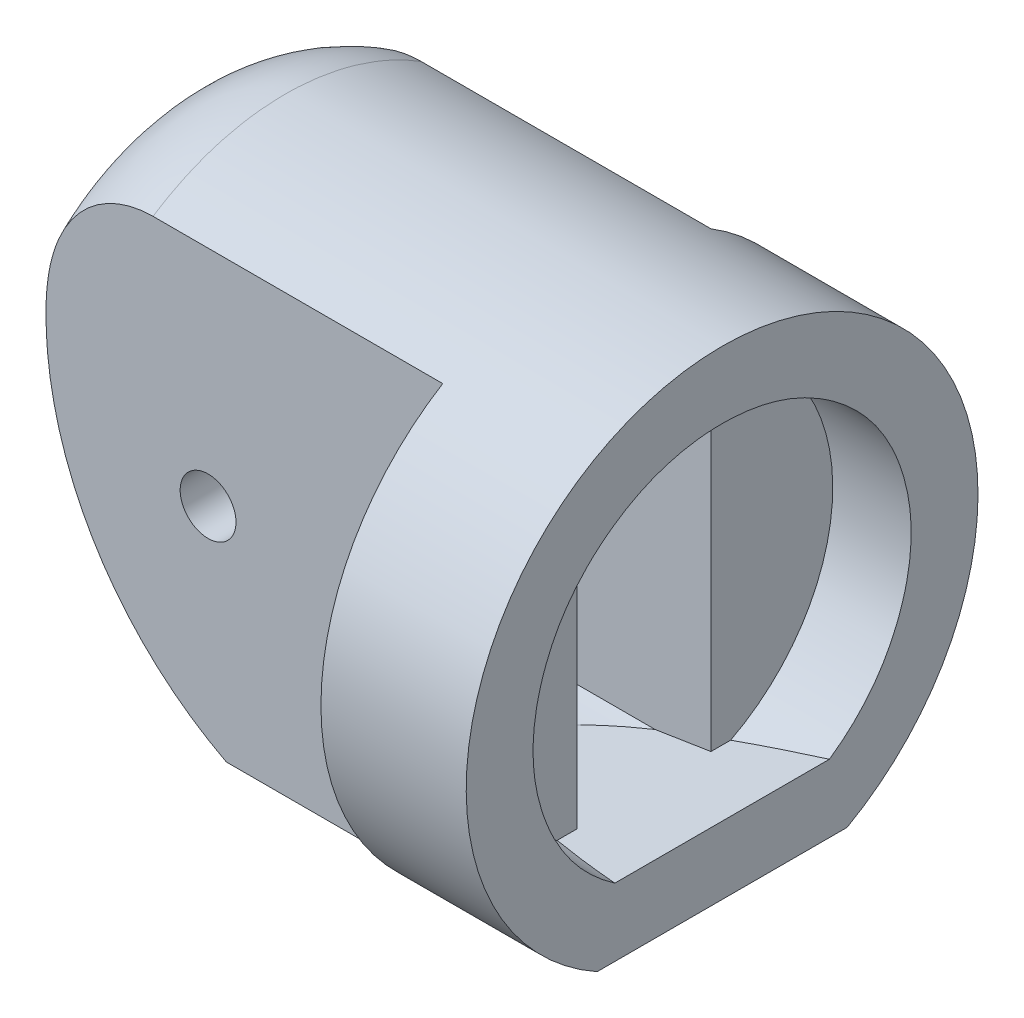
ISO-10303-21;
HEADER;
FILE_DESCRIPTION(('STEP AP214'),'2;1');
FILE_NAME('part.step','',(''),(''),'','','');
FILE_SCHEMA(('AUTOMOTIVE_DESIGN { 1 0 10303 214 1 1 1 1 }'));
ENDSEC;
DATA;
#1=APPLICATION_CONTEXT('core data for automotive mechanical design processes');
#2=APPLICATION_PROTOCOL_DEFINITION('international standard','automotive_design',2000,#1);
#3=PRODUCT_CONTEXT('',#1,'mechanical');
#4=PRODUCT('Part','Part','',(#3));
#5=PRODUCT_RELATED_PRODUCT_CATEGORY('part','',(#4));
#6=PRODUCT_DEFINITION_FORMATION('','',#4);
#7=PRODUCT_DEFINITION_CONTEXT('part definition',#1,'design');
#8=PRODUCT_DEFINITION('design','',#6,#7);
#9=PRODUCT_DEFINITION_SHAPE('','',#8);
#10=(LENGTH_UNIT() NAMED_UNIT(*) SI_UNIT(.MILLI.,.METRE.));
#11=(NAMED_UNIT(*) PLANE_ANGLE_UNIT() SI_UNIT($,.RADIAN.));
#12=(NAMED_UNIT(*) SI_UNIT($,.STERADIAN.) SOLID_ANGLE_UNIT());
#13=UNCERTAINTY_MEASURE_WITH_UNIT(LENGTH_MEASURE(1.E-05),#10,'distance_accuracy_value','');
#14=(GEOMETRIC_REPRESENTATION_CONTEXT(3) GLOBAL_UNCERTAINTY_ASSIGNED_CONTEXT((#13)) GLOBAL_UNIT_ASSIGNED_CONTEXT((#10,
#11,#12)) REPRESENTATION_CONTEXT('',''));
#15=CARTESIAN_POINT('',(0.,0.,0.));
#16=DIRECTION('',(0.,0.,1.));
#17=DIRECTION('',(1.,0.,0.));
#18=AXIS2_PLACEMENT_3D('',#15,#16,#17);
#19=CARTESIAN_POINT('',(-25.,11.45,-11.45));
#20=DIRECTION('',(0.996194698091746,0.0871557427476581,0.));
#21=DIRECTION('',(-0.0871557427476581,0.996194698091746,0.));
#22=AXIS2_PLACEMENT_3D('',#19,#20,#21);
#23=PLANE('',#22);
#24=DIRECTION('',(0.,0.,1.));
#25=VECTOR('',#24,1.);
#26=CARTESIAN_POINT('',(-24.1944624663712,2.24266385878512,-11.45));
#27=LINE('',#26,#25);
#28=CARTESIAN_POINT('',(-24.1944624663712,2.24266385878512,3.));
#29=VERTEX_POINT('',#28);
#30=CARTESIAN_POINT('',(-24.1944624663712,2.24266385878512,5.86757576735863));
#31=VERTEX_POINT('',#30);
#32=EDGE_CURVE('E329',#29,#31,#27,.T.);
#33=ORIENTED_EDGE('',*,*,#32,.T.);
#34=CARTESIAN_POINT('',(-23.9601291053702,-0.43577871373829,0.));
#35=DIRECTION('',(0.996194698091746,0.0871557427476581,0.));
#36=DIRECTION('',(-0.0871557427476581,0.996194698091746,0.));
#37=AXIS2_PLACEMENT_3D('',#34,#35,#36);
#38=ELLIPSE('',#37,6.47463795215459,6.45);
#39=CARTESIAN_POINT('',(-24.4596771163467,5.27408117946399,3.));
#40=VERTEX_POINT('',#39);
#41=EDGE_CURVE('E322',#31,#40,#38,.F.);
#42=ORIENTED_EDGE('',*,*,#41,.T.);
#43=DIRECTION('',(0.0871557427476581,-0.996194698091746,0.));
#44=VECTOR('',#43,1.);
#45=CARTESIAN_POINT('',(-23.0117283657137,-11.2760487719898,3.));
#46=LINE('',#45,#44);
#47=EDGE_CURVE('E326',#40,#29,#46,.T.);
#48=ORIENTED_EDGE('',*,*,#47,.T.);
#49=EDGE_LOOP('',(#33,#42,#48));
#50=FACE_BOUND('',#49,.T.);
#51=ADVANCED_FACE('F36',(#50),#23,.F.);
#52=CARTESIAN_POINT('',(-17.,-0.247948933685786,-11.45));
#53=DIRECTION('',(0.,0.,1.));
#54=DIRECTION('',(1.,0.,0.));
#55=AXIS2_PLACEMENT_3D('',#52,#53,#54);
#56=CYLINDRICAL_SURFACE('',#55,1.25);
#57=CARTESIAN_POINT('',(-17.,-0.247948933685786,-3.));
#58=DIRECTION('',(0.,0.,-1.));
#59=DIRECTION('',(-1.,0.,0.));
#60=AXIS2_PLACEMENT_3D('',#57,#58,#59);
#61=CIRCLE('',#60,1.25);
#62=CARTESIAN_POINT('',(-18.25,-0.247948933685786,-3.));
#63=VERTEX_POINT('',#62);
#64=EDGE_CURVE('E450',#63,#63,#61,.T.);
#65=ORIENTED_EDGE('',*,*,#64,.F.);
#66=EDGE_LOOP('',(#65));
#67=FACE_BOUND('',#66,.T.);
#68=CARTESIAN_POINT('',(-17.,-0.247948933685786,-6.));
#69=DIRECTION('',(0.,0.,1.));
#70=DIRECTION('',(1.,0.,0.));
#71=AXIS2_PLACEMENT_3D('',#68,#69,#70);
#72=CIRCLE('',#71,1.25);
#73=CARTESIAN_POINT('',(-15.75,-0.247948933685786,-6.));
#74=VERTEX_POINT('',#73);
#75=EDGE_CURVE('E382',#74,#74,#72,.T.);
#76=ORIENTED_EDGE('',*,*,#75,.F.);
#77=EDGE_LOOP('',(#76));
#78=FACE_BOUND('',#77,.T.);
#79=ADVANCED_FACE('F275',(#67,#78),#56,.F.);
#80=CARTESIAN_POINT('',(-25.,-11.45,-6.));
#81=DIRECTION('',(0.,0.,1.));
#82=DIRECTION('',(1.,0.,0.));
#83=AXIS2_PLACEMENT_3D('',#80,#81,#82);
#84=PLANE('',#83);
#85=ORIENTED_EDGE('',*,*,#75,.T.);
#86=EDGE_LOOP('',(#85));
#87=FACE_BOUND('',#86,.T.);
#88=CARTESIAN_POINT('',(-9.25154199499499,3.55,-6.));
#89=DIRECTION('',(0.,0.,1.));
#90=DIRECTION('',(1.,0.,0.));
#91=AXIS2_PLACEMENT_3D('',#88,#89,#90);
#92=CIRCLE('',#91,15.);
#93=CARTESIAN_POINT('',(-16.1837449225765,-9.75205106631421,-6.));
#94=VERTEX_POINT('',#93);
#95=CARTESIAN_POINT('',(-24.1831672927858,2.11941761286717,-6.));
#96=VERTEX_POINT('',#95);
#97=EDGE_CURVE('E390',#94,#96,#92,.F.);
#98=ORIENTED_EDGE('',*,*,#97,.T.);
#99=CARTESIAN_POINT('',(-24.5244309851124,6.01422128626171,0.));
#100=CARTESIAN_POINT('',(-25.,11.45,0.));
#101=CARTESIAN_POINT('',(-19.5434574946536,11.45,0.));
#102=CARTESIAN_POINT('',(-24.5244309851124,6.01422128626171,0.28143997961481));
#103=CARTESIAN_POINT('',(-25.,11.45,0.520440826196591));
#104=CARTESIAN_POINT('',(-19.5434574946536,11.45,0.499610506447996));
#105=CARTESIAN_POINT('',(-24.5228170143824,5.9957735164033,0.562879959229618));
#106=CARTESIAN_POINT('',(-24.9968964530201,11.4145262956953,1.04073952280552));
#107=CARTESIAN_POINT('',(-19.5418435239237,11.4172516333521,0.999221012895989));
#108=CARTESIAN_POINT('',(-24.5163891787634,5.9223030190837,1.12094399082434));
#109=CARTESIAN_POINT('',(-24.9845439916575,11.2733370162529,2.07155251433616));
#110=CARTESIAN_POINT('',(-19.5354156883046,11.2868272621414,1.98989282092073));
#111=CARTESIAN_POINT('',(-24.5115749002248,5.86727556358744,1.39756741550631));
#112=CARTESIAN_POINT('',(-24.9753009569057,11.1676886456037,2.58179243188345));
#113=CARTESIAN_POINT('',(-19.530601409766,11.1891428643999,2.48095300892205));
#114=CARTESIAN_POINT('',(-24.4988292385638,5.7215919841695,1.94126612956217));
#115=CARTESIAN_POINT('',(-24.9508644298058,10.8883778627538,3.58266956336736));
#116=CARTESIAN_POINT('',(-19.5178557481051,10.9305262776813,3.44612359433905));
#117=CARTESIAN_POINT('',(-24.4908970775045,5.63092696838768,2.20833901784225));
#118=CARTESIAN_POINT('',(-24.9356822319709,10.7148445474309,4.07306123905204));
#119=CARTESIAN_POINT('',(-19.5099235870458,10.769578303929,3.92022972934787));
#120=CARTESIAN_POINT('',(-24.4720517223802,5.41552357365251,2.72836899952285));
#121=CARTESIAN_POINT('',(-24.8996886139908,10.3034356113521,5.02493096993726));
#122=CARTESIAN_POINT('',(-19.4910782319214,10.3871955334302,4.84338372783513));
#123=CARTESIAN_POINT('',(-24.4611374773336,5.2907731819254,2.98132107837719));
#124=CARTESIAN_POINT('',(-24.8788930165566,10.0657408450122,5.4862089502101));
#125=CARTESIAN_POINT('',(-19.4801639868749,10.1657394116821,5.29242268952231));
#126=CARTESIAN_POINT('',(-24.4365149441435,5.00933633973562,3.4687841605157));
#127=CARTESIAN_POINT('',(-24.8321090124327,9.53099723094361,6.37127845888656));
#128=CARTESIAN_POINT('',(-19.4555414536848,9.66613447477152,6.15776412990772));
#129=CARTESIAN_POINT('',(-24.4228054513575,4.85263612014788,3.70328715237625));
#130=CARTESIAN_POINT('',(-24.8061397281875,9.23416695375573,6.79492838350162));
#131=CARTESIAN_POINT('',(-19.4418319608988,9.38796121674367,6.57405238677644));
#132=CARTESIAN_POINT('',(-24.3928271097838,4.50998210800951,4.14984271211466));
#133=CARTESIAN_POINT('',(-24.7495453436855,8.58729017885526,7.59710103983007));
#134=CARTESIAN_POINT('',(-19.411853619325,8.77968393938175,7.36677504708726));
#135=CARTESIAN_POINT('',(-24.3765570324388,4.32401427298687,4.36188442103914));
#136=CARTESIAN_POINT('',(-24.7189412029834,8.23748324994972,7.97554911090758));
#137=CARTESIAN_POINT('',(-19.3955835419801,8.44955499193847,7.74319017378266));
#138=CARTESIAN_POINT('',(-24.3417358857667,3.92600674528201,4.75989208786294));
#139=CARTESIAN_POINT('',(-24.6536976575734,7.49174611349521,8.68076008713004));
#140=CARTESIAN_POINT('',(-19.3607623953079,7.74301449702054,8.44973091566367));
#141=CARTESIAN_POINT('',(-24.323183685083,3.71395412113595,4.94584501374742));
#142=CARTESIAN_POINT('',(-24.6190794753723,7.09605848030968,9.00751872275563));
#143=CARTESIAN_POINT('',(-19.3422101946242,7.36657999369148,8.77983339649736));
#144=CARTESIAN_POINT('',(-24.2841155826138,3.26740366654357,5.2884953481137));
#145=CARTESIAN_POINT('',(-24.5464935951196,6.26639807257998,9.60398035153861));
#146=CARTESIAN_POINT('',(-19.303142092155,6.57386639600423,9.38810414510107));
#147=CARTESIAN_POINT('',(-24.2635987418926,3.0328951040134,5.44517866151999));
#148=CARTESIAN_POINT('',(-24.508545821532,5.83265303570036,9.87374784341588));
#149=CARTESIAN_POINT('',(-19.2826252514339,6.15756825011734,9.66624739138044));
#150=CARTESIAN_POINT('',(-24.2209521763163,2.54544262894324,5.72660957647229));
#151=CARTESIAN_POINT('',(-24.4300330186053,4.93524759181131,10.3521040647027));
#152=CARTESIAN_POINT('',(-19.2399786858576,5.29224563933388,10.1658418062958));
#153=CARTESIAN_POINT('',(-24.1988217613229,2.29249082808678,5.85134340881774));
#154=CARTESIAN_POINT('',(-24.3894851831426,4.47178371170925,10.5608197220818));
#155=CARTESIAN_POINT('',(-19.2178482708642,4.84320717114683,10.3872685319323));
#156=CARTESIAN_POINT('',(-24.1533264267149,1.77247677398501,6.06674035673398));
#157=CARTESIAN_POINT('',(-24.3065328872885,3.52363463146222,10.9142155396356));
#158=CARTESIAN_POINT('',(-19.1723529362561,3.92008144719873,10.7696398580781));
#159=CARTESIAN_POINT('',(-24.1299610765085,1.50540959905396,6.1573914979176));
#160=CARTESIAN_POINT('',(-24.2641416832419,3.03910095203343,11.0590746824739));
#161=CARTESIAN_POINT('',(-19.1489875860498,3.44598545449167,10.9305632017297));
#162=CARTESIAN_POINT('',(-24.0823953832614,0.961731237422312,6.30306972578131));
#163=CARTESIAN_POINT('',(-24.1782747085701,2.05763694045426,11.2831513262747));
#164=CARTESIAN_POINT('',(-19.1014218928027,2.48085099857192,11.1891702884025));
#165=CARTESIAN_POINT('',(-24.0581948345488,0.685117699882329,6.35808797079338));
#166=CARTESIAN_POINT('',(-24.134807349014,1.56080274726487,11.3625863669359));
#167=CARTESIAN_POINT('',(-19.0772213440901,1.98980836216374,11.2868383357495));
#168=CARTESIAN_POINT('',(-24.0093725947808,0.127076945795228,6.43155545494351));
#169=CARTESIAN_POINT('',(-24.0475562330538,0.563517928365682,11.4554155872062));
#170=CARTESIAN_POINT('',(-19.028399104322,0.999177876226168,11.4172573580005));
#171=CARTESIAN_POINT('',(-23.9847508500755,-0.154350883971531,6.45));
#172=CARTESIAN_POINT('',(-24.0037754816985,0.0631016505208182,11.4690502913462));
#173=CARTESIAN_POINT('',(-19.0037773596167,0.499588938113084,11.45));
#174=CARTESIAN_POINT('',(-23.9355073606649,-0.717206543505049,6.45));
#175=CARTESIAN_POINT('',(-23.9166483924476,-0.932765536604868,11.4310220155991));
#176=CARTESIAN_POINT('',(-18.9545338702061,-0.499588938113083,11.45));
#177=CARTESIAN_POINT('',(-23.9108856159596,-0.998634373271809,6.43155545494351));
#178=CARTESIAN_POINT('',(-23.8732994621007,-1.42824607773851,11.3796059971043));
#179=CARTESIAN_POINT('',(-18.9299121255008,-0.999177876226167,11.4172573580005));
#180=CARTESIAN_POINT('',(-23.8620633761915,-1.55667512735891,6.35808797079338));
#181=CARTESIAN_POINT('',(-23.7877578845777,-2.40599078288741,11.2132828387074));
#182=CARTESIAN_POINT('',(-18.8810898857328,-1.98980836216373,11.2868383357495));
#183=CARTESIAN_POINT('',(-23.8378628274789,-1.83328866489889,6.30306972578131));
#184=CARTESIAN_POINT('',(-23.7455572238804,-2.88834654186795,11.0986126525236));
#185=CARTESIAN_POINT('',(-18.8568893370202,-2.48085099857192,11.1891702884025));
#186=CARTESIAN_POINT('',(-23.7902971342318,-2.37696702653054,6.1573914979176));
#187=CARTESIAN_POINT('',(-23.6629953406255,-3.83203318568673,10.8085629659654));
#188=CARTESIAN_POINT('',(-18.8093236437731,-3.44598545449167,10.9305632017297));
#189=CARTESIAN_POINT('',(-23.7669317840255,-2.64403420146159,6.06674035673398));
#190=CARTESIAN_POINT('',(-23.6226212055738,-4.29351166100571,10.6333950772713));
#191=CARTESIAN_POINT('',(-18.7859582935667,-3.92008144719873,10.7696398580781));
#192=CARTESIAN_POINT('',(-23.7214364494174,-3.16404825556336,5.85134340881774));
#193=CARTESIAN_POINT('',(-23.5443486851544,-5.18817066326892,10.2260139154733));
#194=CARTESIAN_POINT('',(-18.7404629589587,-4.84320717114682,10.3872685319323));
#195=CARTESIAN_POINT('',(-23.699306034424,-3.41700005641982,5.7266095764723));
#196=CARTESIAN_POINT('',(-23.5064333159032,-5.62154531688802,9.99397358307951));
#197=CARTESIAN_POINT('',(-18.7183325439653,-5.29224563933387,10.1658418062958));
#198=CARTESIAN_POINT('',(-23.6566594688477,-3.90445253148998,5.44517866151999));
#199=CARTESIAN_POINT('',(-23.4336611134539,-6.4533353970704,9.47729845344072));
#200=CARTESIAN_POINT('',(-18.675685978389,-6.15756825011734,9.66624739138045));
#201=CARTESIAN_POINT('',(-23.6361426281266,-4.13896109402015,5.2884953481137));
#202=CARTESIAN_POINT('',(-23.3987843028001,-6.85197916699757,9.19278735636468));
#203=CARTESIAN_POINT('',(-18.6551691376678,-6.57386639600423,9.38810414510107));
#204=CARTESIAN_POINT('',(-23.5970745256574,-4.58551154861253,4.94584501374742));
#205=CARTESIAN_POINT('',(-23.3326130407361,-7.60832015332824,8.5763134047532));
#206=CARTESIAN_POINT('',(-18.6161010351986,-7.36657999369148,8.77983339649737));
#207=CARTESIAN_POINT('',(-23.5785223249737,-4.79756417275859,4.75989208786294));
#208=CARTESIAN_POINT('',(-23.3012968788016,-7.96626552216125,8.24441778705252));
#209=CARTESIAN_POINT('',(-18.5975488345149,-7.74301449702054,8.44973091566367));
#210=CARTESIAN_POINT('',(-23.5437011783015,-5.19557170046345,4.36188442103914));
#211=CARTESIAN_POINT('',(-23.2427073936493,-8.63594640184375,7.53891514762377));
#212=CARTESIAN_POINT('',(-18.5627276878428,-8.44955499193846,7.74319017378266));
#213=CARTESIAN_POINT('',(-23.5274311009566,-5.38153953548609,4.14984271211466));
#214=CARTESIAN_POINT('',(-23.215411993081,-8.94793425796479,7.16531542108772));
#215=CARTESIAN_POINT('',(-18.5464576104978,-8.77968393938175,7.36677504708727));
#216=CARTESIAN_POINT('',(-23.4974527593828,-5.72419354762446,3.70328715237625));
#217=CARTESIAN_POINT('',(-23.1652576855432,-9.52120061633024,6.38265003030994));
#218=CARTESIAN_POINT('',(-18.5164792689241,-9.38796121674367,6.57405238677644));
#219=CARTESIAN_POINT('',(-23.4837432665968,-5.8808937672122,3.4687841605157));
#220=CARTESIAN_POINT('',(-23.1423777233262,-9.78271978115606,5.97353217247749));
#221=CARTESIAN_POINT('',(-18.5027697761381,-9.66613447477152,6.15776412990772));
#222=CARTESIAN_POINT('',(-23.4591207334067,-6.16233060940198,2.98132107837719));
#223=CARTESIAN_POINT('',(-23.1013784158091,-10.2513440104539,5.12649035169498));
#224=CARTESIAN_POINT('',(-18.478147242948,-10.1657394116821,5.29242268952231));
#225=CARTESIAN_POINT('',(-23.4482064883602,-6.28708100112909,2.72836899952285));
#226=CARTESIAN_POINT('',(-23.0832403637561,-10.4586628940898,4.68845904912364));
#227=CARTESIAN_POINT('',(-18.4672329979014,-10.3871955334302,4.84338372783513));
#228=CARTESIAN_POINT('',(-23.4293611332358,-6.50248439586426,2.20833901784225));
#229=CARTESIAN_POINT('',(-23.051977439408,-10.815999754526,3.79057555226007));
#230=CARTESIAN_POINT('',(-18.4483876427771,-10.769578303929,3.92022972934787));
#231=CARTESIAN_POINT('',(-23.4214289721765,-6.59314941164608,1.94126612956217));
#232=CARTESIAN_POINT('',(-23.0388373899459,-10.9661912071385,3.33056882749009));
#233=CARTESIAN_POINT('',(-18.4404554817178,-10.9305262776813,3.44612359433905));
#234=CARTESIAN_POINT('',(-23.4086833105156,-6.73883299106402,1.39756741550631));
#235=CARTESIAN_POINT('',(-23.0177500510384,-11.2072205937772,2.39595774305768));
#236=CARTESIAN_POINT('',(-18.4277098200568,-11.1891428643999,2.48095300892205));
#237=CARTESIAN_POINT('',(-23.403869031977,-6.79386044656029,1.12094399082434));
#238=CARTESIAN_POINT('',(-23.0097920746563,-11.2981806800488,1.92116272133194));
#239=CARTESIAN_POINT('',(-18.4228955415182,-11.2868272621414,1.98989282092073));
#240=CARTESIAN_POINT('',(-23.3974411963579,-6.86733094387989,0.56287995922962));
#241=CARTESIAN_POINT('',(-22.9991746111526,-11.4195388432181,0.96435051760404));
#242=CARTESIAN_POINT('',(-18.4164677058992,-11.4172516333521,0.999221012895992));
#243=CARTESIAN_POINT('',(-23.395827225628,-6.88577871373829,0.28143997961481));
#244=CARTESIAN_POINT('',(-22.9965096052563,-11.45,0.482119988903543));
#245=CARTESIAN_POINT('',(-18.4148537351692,-11.45,0.499610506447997));
#246=CARTESIAN_POINT('',(-23.395827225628,-6.88577871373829,-0.281439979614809));
#247=CARTESIAN_POINT('',(-22.9965096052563,-11.45,-0.48211998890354));
#248=CARTESIAN_POINT('',(-18.4148537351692,-11.45,-0.499610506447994));
#249=CARTESIAN_POINT('',(-23.3974411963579,-6.86733094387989,-0.562879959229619));
#250=CARTESIAN_POINT('',(-22.9991746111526,-11.4195388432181,-0.964350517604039));
#251=CARTESIAN_POINT('',(-18.4164677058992,-11.4172516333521,-0.99922101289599));
#252=CARTESIAN_POINT('',(-23.403869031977,-6.79386044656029,-1.12094399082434));
#253=CARTESIAN_POINT('',(-23.0097920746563,-11.2981806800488,-1.92116272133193));
#254=CARTESIAN_POINT('',(-18.4228955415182,-11.2868272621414,-1.98989282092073));
#255=CARTESIAN_POINT('',(-23.4086833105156,-6.73883299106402,-1.39756741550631));
#256=CARTESIAN_POINT('',(-23.0177500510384,-11.2072205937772,-2.39595774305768));
#257=CARTESIAN_POINT('',(-18.4277098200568,-11.1891428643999,-2.48095300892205));
#258=CARTESIAN_POINT('',(-23.4214289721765,-6.59314941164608,-1.94126612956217));
#259=CARTESIAN_POINT('',(-23.0388373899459,-10.9661912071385,-3.33056882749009));
#260=CARTESIAN_POINT('',(-18.4404554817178,-10.9305262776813,-3.44612359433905));
#261=CARTESIAN_POINT('',(-23.4293611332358,-6.50248439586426,-2.20833901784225));
#262=CARTESIAN_POINT('',(-23.051977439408,-10.815999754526,-3.79057555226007));
#263=CARTESIAN_POINT('',(-18.4483876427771,-10.769578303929,-3.92022972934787));
#264=CARTESIAN_POINT('',(-23.4482064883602,-6.28708100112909,-2.72836899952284));
#265=CARTESIAN_POINT('',(-23.0832403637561,-10.4586628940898,-4.68845904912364));
#266=CARTESIAN_POINT('',(-18.4672329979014,-10.3871955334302,-4.84338372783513));
#267=CARTESIAN_POINT('',(-23.4591207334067,-6.16233060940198,-2.98132107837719));
#268=CARTESIAN_POINT('',(-23.1013784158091,-10.2513440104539,-5.12649035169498));
#269=CARTESIAN_POINT('',(-18.478147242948,-10.1657394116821,-5.2924226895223));
#270=CARTESIAN_POINT('',(-23.4837432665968,-5.8808937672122,-3.4687841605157));
#271=CARTESIAN_POINT('',(-23.1423777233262,-9.78271978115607,-5.97353217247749));
#272=CARTESIAN_POINT('',(-18.5027697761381,-9.66613447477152,-6.15776412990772));
#273=CARTESIAN_POINT('',(-23.4974527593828,-5.72419354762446,-3.70328715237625));
#274=CARTESIAN_POINT('',(-23.1652576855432,-9.52120061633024,-6.38265003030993));
#275=CARTESIAN_POINT('',(-18.5164792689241,-9.38796121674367,-6.57405238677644));
#276=CARTESIAN_POINT('',(-23.5274311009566,-5.38153953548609,-4.14984271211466));
#277=CARTESIAN_POINT('',(-23.215411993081,-8.94793425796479,-7.16531542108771));
#278=CARTESIAN_POINT('',(-18.5464576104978,-8.77968393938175,-7.36677504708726));
#279=CARTESIAN_POINT('',(-23.5437011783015,-5.19557170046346,-4.36188442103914));
#280=CARTESIAN_POINT('',(-23.2427073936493,-8.63594640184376,-7.53891514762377));
#281=CARTESIAN_POINT('',(-18.5627276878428,-8.44955499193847,-7.74319017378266));
#282=CARTESIAN_POINT('',(-23.5785223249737,-4.7975641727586,-4.75989208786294));
#283=CARTESIAN_POINT('',(-23.3012968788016,-7.96626552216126,-8.24441778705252));
#284=CARTESIAN_POINT('',(-18.5975488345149,-7.74301449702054,-8.44973091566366));
#285=CARTESIAN_POINT('',(-23.5970745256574,-4.58551154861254,-4.94584501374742));
#286=CARTESIAN_POINT('',(-23.3326130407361,-7.60832015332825,-8.5763134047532));
#287=CARTESIAN_POINT('',(-18.6161010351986,-7.36657999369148,-8.77983339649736));
#288=CARTESIAN_POINT('',(-23.6361426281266,-4.13896109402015,-5.2884953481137));
#289=CARTESIAN_POINT('',(-23.3987843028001,-6.85197916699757,-9.19278735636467));
#290=CARTESIAN_POINT('',(-18.6551691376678,-6.57386639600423,-9.38810414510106));
#291=CARTESIAN_POINT('',(-23.6566594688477,-3.90445253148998,-5.44517866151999));
#292=CARTESIAN_POINT('',(-23.4336611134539,-6.45333539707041,-9.47729845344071));
#293=CARTESIAN_POINT('',(-18.675685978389,-6.15756825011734,-9.66624739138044));
#294=CARTESIAN_POINT('',(-23.699306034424,-3.41700005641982,-5.72660957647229));
#295=CARTESIAN_POINT('',(-23.5064333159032,-5.62154531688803,-9.9939735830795));
#296=CARTESIAN_POINT('',(-18.7183325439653,-5.29224563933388,-10.1658418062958));
#297=CARTESIAN_POINT('',(-23.7214364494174,-3.16404825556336,-5.85134340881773));
#298=CARTESIAN_POINT('',(-23.5443486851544,-5.18817066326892,-10.2260139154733));
#299=CARTESIAN_POINT('',(-18.7404629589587,-4.84320717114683,-10.3872685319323));
#300=CARTESIAN_POINT('',(-23.7669317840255,-2.64403420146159,-6.06674035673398));
#301=CARTESIAN_POINT('',(-23.6226212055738,-4.29351166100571,-10.6333950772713));
#302=CARTESIAN_POINT('',(-18.7859582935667,-3.92008144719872,-10.7696398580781));
#303=CARTESIAN_POINT('',(-23.7902971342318,-2.37696702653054,-6.1573914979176));
#304=CARTESIAN_POINT('',(-23.6629953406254,-3.83203318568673,-10.8085629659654));
#305=CARTESIAN_POINT('',(-18.8093236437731,-3.44598545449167,-10.9305632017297));
#306=CARTESIAN_POINT('',(-23.8378628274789,-1.83328866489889,-6.30306972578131));
#307=CARTESIAN_POINT('',(-23.7455572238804,-2.88834654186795,-11.0986126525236));
#308=CARTESIAN_POINT('',(-18.8568893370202,-2.48085099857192,-11.1891702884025));
#309=CARTESIAN_POINT('',(-23.8620633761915,-1.55667512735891,-6.35808797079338));
#310=CARTESIAN_POINT('',(-23.7877578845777,-2.40599078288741,-11.2132828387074));
#311=CARTESIAN_POINT('',(-18.8810898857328,-1.98980836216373,-11.2868383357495));
#312=CARTESIAN_POINT('',(-23.9108856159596,-0.998634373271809,-6.43155545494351));
#313=CARTESIAN_POINT('',(-23.8732994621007,-1.42824607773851,-11.3796059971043));
#314=CARTESIAN_POINT('',(-18.9299121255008,-0.999177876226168,-11.4172573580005));
#315=CARTESIAN_POINT('',(-23.9355073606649,-0.717206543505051,-6.45));
#316=CARTESIAN_POINT('',(-23.9166483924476,-0.93276553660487,-11.4310220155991));
#317=CARTESIAN_POINT('',(-18.9545338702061,-0.499588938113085,-11.45));
#318=CARTESIAN_POINT('',(-23.9847508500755,-0.154350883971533,-6.45));
#319=CARTESIAN_POINT('',(-24.0037754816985,0.0631016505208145,-11.4690502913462));
#320=CARTESIAN_POINT('',(-19.0037773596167,0.499588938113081,-11.45));
#321=CARTESIAN_POINT('',(-24.0093725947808,0.127076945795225,-6.43155545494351));
#322=CARTESIAN_POINT('',(-24.0475562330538,0.563517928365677,-11.4554155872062));
#323=CARTESIAN_POINT('',(-19.028399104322,0.999177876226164,-11.4172573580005));
#324=CARTESIAN_POINT('',(-24.0581948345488,0.685117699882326,-6.35808797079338));
#325=CARTESIAN_POINT('',(-24.134807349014,1.56080274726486,-11.3625863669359));
#326=CARTESIAN_POINT('',(-19.0772213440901,1.98980836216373,-11.2868383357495));
#327=CARTESIAN_POINT('',(-24.0823953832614,0.961731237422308,-6.30306972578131));
#328=CARTESIAN_POINT('',(-24.1782747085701,2.05763694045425,-11.2831513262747));
#329=CARTESIAN_POINT('',(-19.1014218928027,2.48085099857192,-11.1891702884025));
#330=CARTESIAN_POINT('',(-24.1299610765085,1.50540959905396,-6.1573914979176));
#331=CARTESIAN_POINT('',(-24.2641416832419,3.03910095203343,-11.0590746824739));
#332=CARTESIAN_POINT('',(-19.1489875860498,3.44598545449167,-10.9305632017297));
#333=CARTESIAN_POINT('',(-24.1533264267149,1.77247677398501,-6.06674035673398));
#334=CARTESIAN_POINT('',(-24.3065328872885,3.52363463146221,-10.9142155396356));
#335=CARTESIAN_POINT('',(-19.1723529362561,3.92008144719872,-10.7696398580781));
#336=CARTESIAN_POINT('',(-24.1988217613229,2.29249082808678,-5.85134340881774));
#337=CARTESIAN_POINT('',(-24.3894851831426,4.47178371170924,-10.5608197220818));
#338=CARTESIAN_POINT('',(-19.2178482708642,4.84320717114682,-10.3872685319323));
#339=CARTESIAN_POINT('',(-24.2209521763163,2.54544262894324,-5.72660957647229));
#340=CARTESIAN_POINT('',(-24.4300330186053,4.93524759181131,-10.3521040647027));
#341=CARTESIAN_POINT('',(-19.2399786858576,5.29224563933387,-10.1658418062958));
#342=CARTESIAN_POINT('',(-24.2635987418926,3.0328951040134,-5.44517866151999));
#343=CARTESIAN_POINT('',(-24.508545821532,5.83265303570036,-9.87374784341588));
#344=CARTESIAN_POINT('',(-19.2826252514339,6.15756825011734,-9.66624739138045));
#345=CARTESIAN_POINT('',(-24.2841155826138,3.26740366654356,-5.2884953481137));
#346=CARTESIAN_POINT('',(-24.5464935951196,6.26639807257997,-9.60398035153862));
#347=CARTESIAN_POINT('',(-19.303142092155,6.57386639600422,-9.38810414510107));
#348=CARTESIAN_POINT('',(-24.323183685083,3.71395412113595,-4.94584501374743));
#349=CARTESIAN_POINT('',(-24.6190794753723,7.09605848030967,-9.00751872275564));
#350=CARTESIAN_POINT('',(-19.3422101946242,7.36657999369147,-8.77983339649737));
#351=CARTESIAN_POINT('',(-24.3417358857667,3.92600674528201,-4.75989208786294));
#352=CARTESIAN_POINT('',(-24.6536976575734,7.4917461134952,-8.68076008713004));
#353=CARTESIAN_POINT('',(-19.3607623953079,7.74301449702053,-8.44973091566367));
#354=CARTESIAN_POINT('',(-24.3765570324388,4.32401427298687,-4.36188442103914));
#355=CARTESIAN_POINT('',(-24.7189412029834,8.23748324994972,-7.97554911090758));
#356=CARTESIAN_POINT('',(-19.3955835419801,8.44955499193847,-7.74319017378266));
#357=CARTESIAN_POINT('',(-24.3928271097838,4.50998210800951,-4.14984271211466));
#358=CARTESIAN_POINT('',(-24.7495453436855,8.58729017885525,-7.59710103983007));
#359=CARTESIAN_POINT('',(-19.411853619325,8.77968393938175,-7.36677504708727));
#360=CARTESIAN_POINT('',(-24.4228054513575,4.85263612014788,-3.70328715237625));
#361=CARTESIAN_POINT('',(-24.8061397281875,9.23416695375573,-6.79492838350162));
#362=CARTESIAN_POINT('',(-19.4418319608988,9.38796121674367,-6.57405238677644));
#363=CARTESIAN_POINT('',(-24.4365149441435,5.00933633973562,-3.46878416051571));
#364=CARTESIAN_POINT('',(-24.8321090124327,9.53099723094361,-6.37127845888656));
#365=CARTESIAN_POINT('',(-19.4555414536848,9.66613447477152,-6.15776412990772));
#366=CARTESIAN_POINT('',(-24.4611374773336,5.2907731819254,-2.9813210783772));
#367=CARTESIAN_POINT('',(-24.8788930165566,10.0657408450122,-5.4862089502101));
#368=CARTESIAN_POINT('',(-19.4801639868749,10.1657394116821,-5.29242268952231));
#369=CARTESIAN_POINT('',(-24.4720517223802,5.41552357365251,-2.72836899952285));
#370=CARTESIAN_POINT('',(-24.8996886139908,10.3034356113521,-5.02493096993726));
#371=CARTESIAN_POINT('',(-19.4910782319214,10.3871955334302,-4.84338372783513));
#372=CARTESIAN_POINT('',(-24.4908970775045,5.63092696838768,-2.20833901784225));
#373=CARTESIAN_POINT('',(-24.9356822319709,10.7148445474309,-4.07306123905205));
#374=CARTESIAN_POINT('',(-19.5099235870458,10.769578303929,-3.92022972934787));
#375=CARTESIAN_POINT('',(-24.4988292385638,5.7215919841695,-1.94126612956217));
#376=CARTESIAN_POINT('',(-24.9508644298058,10.8883778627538,-3.58266956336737));
#377=CARTESIAN_POINT('',(-19.5178557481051,10.9305262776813,-3.44612359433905));
#378=CARTESIAN_POINT('',(-24.5115749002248,5.86727556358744,-1.39756741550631));
#379=CARTESIAN_POINT('',(-24.9753009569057,11.1676886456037,-2.58179243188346));
#380=CARTESIAN_POINT('',(-19.530601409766,11.1891428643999,-2.48095300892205));
#381=CARTESIAN_POINT('',(-24.5163891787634,5.9223030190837,-1.12094399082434));
#382=CARTESIAN_POINT('',(-24.9845439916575,11.2733370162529,-2.07155251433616));
#383=CARTESIAN_POINT('',(-19.5354156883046,11.2868272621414,-1.98989282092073));
#384=CARTESIAN_POINT('',(-24.5228170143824,5.9957735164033,-0.562879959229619));
#385=CARTESIAN_POINT('',(-24.9968964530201,11.4145262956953,-1.04073952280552));
#386=CARTESIAN_POINT('',(-19.5418435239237,11.4172516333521,-0.99922101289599));
#387=CARTESIAN_POINT('',(-24.5244309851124,6.01422128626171,-0.281439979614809));
#388=CARTESIAN_POINT('',(-25.,11.45,-0.52044082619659));
#389=CARTESIAN_POINT('',(-19.5434574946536,11.45,-0.499610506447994));
#390=CARTESIAN_POINT('',(-24.5244309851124,6.01422128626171,0.));
#391=CARTESIAN_POINT('',(-25.,11.45,0.));
#392=CARTESIAN_POINT('',(-19.5434574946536,11.45,0.));
#393=(BOUNDED_SURFACE() B_SPLINE_SURFACE(3,2,((#99,#100,#101),(#102,#103,#104),(#105,#106,#107),
(#108,#109,#110),(#111,#112,#113),(#114,#115,#116),(#117,#118,#119),(#120,#121,#122),(#123,#124,
#125),(#126,#127,#128),(#129,#130,#131),(#132,#133,#134),(#135,#136,#137),(#138,#139,#140),
(#141,#142,#143),(#144,#145,#146),(#147,#148,#149),(#150,#151,#152),(#153,#154,#155),(#156,#157,
#158),(#159,#160,#161),(#162,#163,#164),(#165,#166,#167),(#168,#169,#170),(#171,#172,#173),
(#174,#175,#176),(#177,#178,#179),(#180,#181,#182),(#183,#184,#185),(#186,#187,#188),(#189,#190,
#191),(#192,#193,#194),(#195,#196,#197),(#198,#199,#200),(#201,#202,#203),(#204,#205,#206),
(#207,#208,#209),(#210,#211,#212),(#213,#214,#215),(#216,#217,#218),(#219,#220,#221),(#222,#223,
#224),(#225,#226,#227),(#228,#229,#230),(#231,#232,#233),(#234,#235,#236),(#237,#238,#239),
(#240,#241,#242),(#243,#244,#245),(#246,#247,#248),(#249,#250,#251),(#252,#253,#254),(#255,#256,
#257),(#258,#259,#260),(#261,#262,#263),(#264,#265,#266),(#267,#268,#269),(#270,#271,#272),
(#273,#274,#275),(#276,#277,#278),(#279,#280,#281),(#282,#283,#284),(#285,#286,#287),(#288,#289,
#290),(#291,#292,#293),(#294,#295,#296),(#297,#298,#299),(#300,#301,#302),(#303,#304,#305),
(#306,#307,#308),(#309,#310,#311),(#312,#313,#314),(#315,#316,#317),(#318,#319,#320),(#321,#322,
#323),(#324,#325,#326),(#327,#328,#329),(#330,#331,#332),(#333,#334,#335),(#336,#337,#338),
(#339,#340,#341),(#342,#343,#344),(#345,#346,#347),(#348,#349,#350),(#351,#352,#353),(#354,#355,
#356),(#357,#358,#359),(#360,#361,#362),(#363,#364,#365),(#366,#367,#368),(#369,#370,#371),
(#372,#373,#374),(#375,#376,#377),(#378,#379,#380),(#381,#382,#383),(#384,#385,#386),(#387,#388,
#389),(#390,#391,#392)),.UNSPECIFIED.,.T.,.F.,.F.) B_SPLINE_SURFACE_WITH_KNOTS((4,2,2,2,2,2,2,2,
2,2,2,2,2,2,2,2,2,2,2,2,2,2,2,2,2,2,2,2,2,2,2,2,2,2,2,2,2,2,2,2,2,2,2,2,2,2,2,2,4),(3,3),(0.,
0.843714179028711,1.68753743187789,2.53157135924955,3.37590313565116,4.22059955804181,
5.06570250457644,5.91122610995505,6.75715584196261,7.60344953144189,8.45004027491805,
9.29684100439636,10.1437504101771,10.9906598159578,11.8374605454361,12.6840512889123,
13.5303449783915,14.3762747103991,15.2217983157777,16.0669012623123,16.911597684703,
17.7559294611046,18.5999633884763,19.4437866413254,20.2875008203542,21.1312149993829,
21.975038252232,22.8190721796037,23.6634039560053,24.508100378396,25.3532033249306,
26.1987269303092,27.0446566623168,27.8909503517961,28.7375410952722,29.5843418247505,
30.4312512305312,31.278160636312,32.1249613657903,32.9715521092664,33.8178457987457,
34.6637755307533,35.5092991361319,36.3544020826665,37.1990985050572,38.0434302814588,
38.8874642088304,39.7312874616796,40.5750016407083),(0.,1.),
.UNSPECIFIED.) GEOMETRIC_REPRESENTATION_ITEM() RATIONAL_B_SPLINE_SURFACE(((1.,0.67559020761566,
1.),(1.,0.67559020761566,1.),(1.,0.675682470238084,1.),(1.,0.676049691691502,1.),(1.,
0.676324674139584,1.),(1.,0.677051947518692,1.),(1.,0.677504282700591,1.),(1.,0.678577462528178,
1.),(1.,0.679198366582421,1.),(1.,0.680596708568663,1.),(1.,0.681374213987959,1.),(1.,
0.683070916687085,1.),(1.,0.683990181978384,1.),(1.,0.685953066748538,1.),(1.,0.68699674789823,
1.),(1.,0.689189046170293,1.),(1.,0.690337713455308,1.),(1.,0.692718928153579,1.),(1.,
0.693951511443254,1.),(1.,0.69647831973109,1.),(1.,0.697772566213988,1.),(1.,0.700399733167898,
1.),(1.,0.701732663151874,1.),(1.,0.704413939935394,1.),(1.,0.70576228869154,1.),(1.,
0.708451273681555,1.),(1.,0.709791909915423,1.),(1.,0.712442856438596,1.),(1.,0.713753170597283,
1.),(1.,0.71632172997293,1.),(1.,0.717579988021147,1.),(1.,0.720023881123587,1.),(1.,
0.721209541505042,1.),(1.,0.723489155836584,1.),(1.,0.724583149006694,1.),(1.,0.726662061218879,
1.),(1.,0.727647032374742,1.),(1.,0.729492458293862,1.),(1.,0.730352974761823,1.),(1.,
0.731936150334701,1.),(1.,0.732658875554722,1.),(1.,0.733955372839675,1.),(1.,0.734529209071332,
1.),(1.,0.73551919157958,1.),(1.,0.735935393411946,1.),(1.,0.736603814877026,1.),(1.,
0.736856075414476,1.),(1.,0.737192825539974,1.),(1.,0.737277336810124,1.),(1.,0.737277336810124,
1.),(1.,0.737192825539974,1.),(1.,0.736856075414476,1.),(1.,0.736603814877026,1.),(1.,
0.735935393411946,1.),(1.,0.73551919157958,1.),(1.,0.734529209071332,1.),(1.,0.733955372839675,
1.),(1.,0.732658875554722,1.),(1.,0.731936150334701,1.),(1.,0.730352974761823,1.),(1.,
0.729492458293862,1.),(1.,0.727647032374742,1.),(1.,0.726662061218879,1.),(1.,0.724583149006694,
1.),(1.,0.723489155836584,1.),(1.,0.721209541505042,1.),(1.,0.720023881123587,1.),(1.,
0.717579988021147,1.),(1.,0.71632172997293,1.),(1.,0.713753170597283,1.),(1.,0.712442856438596,
1.),(1.,0.709791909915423,1.),(1.,0.708451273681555,1.),(1.,0.70576228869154,1.),(1.,
0.704413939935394,1.),(1.,0.701732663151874,1.),(1.,0.700399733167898,1.),(1.,0.697772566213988,
1.),(1.,0.69647831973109,1.),(1.,0.693951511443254,1.),(1.,0.692718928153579,1.),(1.,
0.690337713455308,1.),(1.,0.689189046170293,1.),(1.,0.68699674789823,1.),(1.,0.685953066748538,
1.),(1.,0.683990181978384,1.),(1.,0.683070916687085,1.),(1.,0.681374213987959,1.),(1.,
0.680596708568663,1.),(1.,0.679198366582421,1.),(1.,0.678577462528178,1.),(1.,0.677504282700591,
1.),(1.,0.677051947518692,1.),(1.,0.676324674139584,1.),(1.,0.676049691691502,1.),(1.,
0.675682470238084,1.),(1.,0.67559020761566,1.),(1.,0.67559020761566,1.))) REPRESENTATION_ITEM('') SURFACE());
#394=CARTESIAN_POINT('',(-24.1831672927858,2.11941761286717,-6.));
#395=CARTESIAN_POINT('',(-24.2049996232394,2.38604369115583,-6.));
#396=CARTESIAN_POINT('',(-24.2233929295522,2.65321190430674,-6.));
#397=CARTESIAN_POINT('',(-24.2479541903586,3.18924365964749,-6.));
#398=CARTESIAN_POINT('',(-24.2540681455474,3.45810949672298,-6.));
#399=CARTESIAN_POINT('',(-24.24839102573,4.00013463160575,-6.));
#400=CARTESIAN_POINT('',(-24.2363095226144,4.27329322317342,-6.));
#401=CARTESIAN_POINT('',(-24.1882962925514,4.81720668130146,-6.));
#402=CARTESIAN_POINT('',(-24.1524083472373,5.08796503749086,-6.));
#403=CARTESIAN_POINT('',(-24.0718835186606,5.51848088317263,-6.));
#404=CARTESIAN_POINT('',(-24.0362660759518,5.67993779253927,-6.));
#405=CARTESIAN_POINT('',(-23.953686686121,5.99991074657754,-6.));
#406=CARTESIAN_POINT('',(-23.906728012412,6.1584276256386,-6.));
#407=CARTESIAN_POINT('',(-23.8009421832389,6.47077039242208,-6.));
#408=CARTESIAN_POINT('',(-23.7421630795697,6.62461245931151,-6.));
#409=CARTESIAN_POINT('',(-23.6120974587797,6.92693306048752,-6.));
#410=CARTESIAN_POINT('',(-23.5408117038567,7.07541192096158,-6.));
#411=CARTESIAN_POINT('',(-23.384450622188,7.36735789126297,-6.));
#412=CARTESIAN_POINT('',(-23.2992135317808,7.51073876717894,-6.));
#413=CARTESIAN_POINT('',(-23.115580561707,7.78880761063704,-6.));
#414=CARTESIAN_POINT('',(-23.0171870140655,7.92349711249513,-6.));
#415=CARTESIAN_POINT('',(-22.8074464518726,8.18252995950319,-6.));
#416=CARTESIAN_POINT('',(-22.6960926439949,8.30686781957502,-6.));
#417=CARTESIAN_POINT('',(-22.4610952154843,8.5433273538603,-6.));
#418=CARTESIAN_POINT('',(-22.3374543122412,8.65545171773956,-6.));
#419=CARTESIAN_POINT('',(-22.0972842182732,8.85074829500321,-6.));
#420=CARTESIAN_POINT('',(-21.9822548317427,8.93576909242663,-6.));
#421=CARTESIAN_POINT('',(-21.7446756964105,9.09454022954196,-6.));
#422=CARTESIAN_POINT('',(-21.6221272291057,9.16829248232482,-6.));
#423=CARTESIAN_POINT('',(-21.3705942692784,9.3035261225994,-6.));
#424=CARTESIAN_POINT('',(-21.241617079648,9.36502105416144,-6.));
#425=CARTESIAN_POINT('',(-20.9783115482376,9.47503230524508,-6.));
#426=CARTESIAN_POINT('',(-20.8439844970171,9.52355173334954,-6.));
#427=CARTESIAN_POINT('',(-20.5058005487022,9.62694077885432,-6.));
#428=CARTESIAN_POINT('',(-20.2993897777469,9.67376680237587,-6.));
#429=CARTESIAN_POINT('',(-19.9864259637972,9.72068552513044,-6.));
#430=CARTESIAN_POINT('',(-19.8814741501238,9.73243842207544,-6.));
#431=CARTESIAN_POINT('',(-19.6709560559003,9.74812159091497,-6.));
#432=CARTESIAN_POINT('',(-19.565389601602,9.75204953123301,-6.));
#433=CARTESIAN_POINT('',(-19.4597757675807,9.75205106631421,-6.));
#434=B_SPLINE_CURVE_WITH_KNOTS('',3,(#394,#395,#396,#397,#398,#399,#400,#401,#402,#403,#404,
#405,#406,#407,#408,#409,#410,#411,#412,#413,#414,#415,#416,#417,#418,#419,#420,#421,#422,#423,
#424,#425,#426,#427,#428,#429,#430,#431,#432,#433),.UNSPECIFIED.,.F.,.F.,(4,2,2,2,2,2,2,2,2,2,2,
2,2,2,2,2,2,2,2,4),(0.,0.802940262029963,1.60940384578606,2.42887699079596,3.24684723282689,
3.74250941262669,4.23802870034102,4.73157293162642,5.22508709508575,5.72479207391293,
6.22440859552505,6.72428818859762,7.22405747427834,7.65256451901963,8.08099873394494,
8.50895688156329,8.93681240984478,9.56910881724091,9.88568840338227,10.2023623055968),.UNSPECIFIED.);
#435=CARTESIAN_POINT('',(-19.4597757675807,9.75205106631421,-6.));
#436=VERTEX_POINT('',#435);
#437=EDGE_CURVE('E48',#96,#436,#434,.T.);
#438=ORIENTED_EDGE('',*,*,#437,.T.);
#439=DIRECTION('',(-1.,0.,0.));
#440=VECTOR('',#439,1.);
#441=CARTESIAN_POINT('',(30.,9.75205106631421,-6.));
#442=LINE('',#441,#440);
#443=CARTESIAN_POINT('',(-6.5,9.75205106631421,-6.));
#444=VERTEX_POINT('',#443);
#445=EDGE_CURVE('E409',#444,#436,#442,.T.);
#446=ORIENTED_EDGE('',*,*,#445,.F.);
#447=DIRECTION('',(0.,1.,0.));
#448=VECTOR('',#447,1.);
#449=CARTESIAN_POINT('',(-6.5,-11.45,-6.));
#450=LINE('',#449,#448);
#451=CARTESIAN_POINT('',(-6.5,-9.75205106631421,-6.));
#452=VERTEX_POINT('',#451);
#453=EDGE_CURVE('E404',#452,#444,#450,.T.);
#454=ORIENTED_EDGE('',*,*,#453,.F.);
#455=DIRECTION('',(-1.,0.,0.));
#456=VECTOR('',#455,1.);
#457=CARTESIAN_POINT('',(30.,-9.75205106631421,-6.));
#458=LINE('',#457,#456);
#459=EDGE_CURVE('E407',#94,#452,#458,.F.);
#460=ORIENTED_EDGE('',*,*,#459,.F.);
#461=EDGE_LOOP('',(#98,#438,#446,#454,#460));
#462=FACE_BOUND('',#461,.T.);
#463=ADVANCED_FACE('F441',(#87,#462),#84,.F.);
#464=CARTESIAN_POINT('',(-25.,-11.45,6.));
#465=DIRECTION('',(0.,0.,-1.));
#466=DIRECTION('',(-1.,0.,0.));
#467=AXIS2_PLACEMENT_3D('',#464,#465,#466);
#468=PLANE('',#467);
#469=CARTESIAN_POINT('',(-17.,-0.247948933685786,6.));
#470=DIRECTION('',(0.,0.,-1.));
#471=DIRECTION('',(-1.,0.,0.));
#472=AXIS2_PLACEMENT_3D('',#469,#470,#471);
#473=CIRCLE('',#472,1.25);
#474=CARTESIAN_POINT('',(-18.25,-0.247948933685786,6.));
#475=VERTEX_POINT('',#474);
#476=EDGE_CURVE('E381',#475,#475,#473,.T.);
#477=ORIENTED_EDGE('',*,*,#476,.T.);
#478=EDGE_LOOP('',(#477));
#479=FACE_BOUND('',#478,.T.);
#480=DIRECTION('',(-1.,0.,0.));
#481=VECTOR('',#480,1.);
#482=CARTESIAN_POINT('',(30.,9.75205106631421,5.99999999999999));
#483=LINE('',#482,#481);
#484=CARTESIAN_POINT('',(-19.4597757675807,9.75205106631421,5.99999999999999));
#485=VERTEX_POINT('',#484);
#486=CARTESIAN_POINT('',(-6.5,9.75205106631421,6.));
#487=VERTEX_POINT('',#486);
#488=EDGE_CURVE('E398',#485,#487,#483,.F.);
#489=ORIENTED_EDGE('',*,*,#488,.F.);
#490=CARTESIAN_POINT('',(-19.4597757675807,9.75205106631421,5.99999999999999));
#491=CARTESIAN_POINT('',(-19.5818707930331,9.75206951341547,6.));
#492=CARTESIAN_POINT('',(-19.7039634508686,9.74680484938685,6.));
#493=CARTESIAN_POINT('',(-19.9472293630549,9.72581856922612,6.));
#494=CARTESIAN_POINT('',(-20.0684027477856,9.71009846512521,6.));
#495=CARTESIAN_POINT('',(-20.3086344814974,9.66836555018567,6.));
#496=CARTESIAN_POINT('',(-20.427697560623,9.64237995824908,6.));
#497=CARTESIAN_POINT('',(-20.6631757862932,9.58036960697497,6.));
#498=CARTESIAN_POINT('',(-20.7795909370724,9.54434486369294,6.));
#499=CARTESIAN_POINT('',(-21.0089404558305,9.46259308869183,6.));
#500=CARTESIAN_POINT('',(-21.1218755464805,9.41686808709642,6.));
#501=CARTESIAN_POINT('',(-21.343555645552,9.3161615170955,6.));
#502=CARTESIAN_POINT('',(-21.4522990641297,9.26117647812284,6.));
#503=CARTESIAN_POINT('',(-21.7711234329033,9.08309031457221,6.));
#504=CARTESIAN_POINT('',(-21.9740038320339,8.94678420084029,6.));
#505=CARTESIAN_POINT('',(-22.3601889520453,8.6404066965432,6.));
#506=CARTESIAN_POINT('',(-22.5429061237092,8.46960264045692,6.));
#507=CARTESIAN_POINT('',(-22.8802124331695,8.10214734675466,6.));
#508=CARTESIAN_POINT('',(-23.0347867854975,7.90548261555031,6.));
#509=CARTESIAN_POINT('',(-23.3282587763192,7.47173172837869,6.));
#510=CARTESIAN_POINT('',(-23.4640735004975,7.23257087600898,6.));
#511=CARTESIAN_POINT('',(-23.7003239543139,6.73767255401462,6.));
#512=CARTESIAN_POINT('',(-23.8007698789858,6.48193988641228,6.));
#513=CARTESIAN_POINT('',(-23.9521325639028,6.01157192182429,6.));
#514=CARTESIAN_POINT('',(-24.0089091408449,5.79876983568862,6.));
#515=CARTESIAN_POINT('',(-24.1031609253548,5.36885982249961,6.));
#516=CARTESIAN_POINT('',(-24.1406253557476,5.15174956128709,6.));
#517=CARTESIAN_POINT('',(-24.1986516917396,4.71442257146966,6.));
#518=CARTESIAN_POINT('',(-24.2191411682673,4.49419656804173,6.));
#519=CARTESIAN_POINT('',(-24.2456563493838,4.05284958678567,6.));
#520=CARTESIAN_POINT('',(-24.2516766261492,3.83172830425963,6.));
#521=CARTESIAN_POINT('',(-24.2522003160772,3.36062030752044,6.));
#522=CARTESIAN_POINT('',(-24.2450941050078,3.1106415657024,6.));
#523=CARTESIAN_POINT('',(-24.2206325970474,2.61343929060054,6.));
#524=CARTESIAN_POINT('',(-24.2033712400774,2.36621140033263,6.));
#525=CARTESIAN_POINT('',(-24.1831672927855,2.11941761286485,6.));
#526=B_SPLINE_CURVE_WITH_KNOTS('',3,(#490,#491,#492,#493,#494,#495,#496,#497,#498,#499,#500,
#501,#502,#503,#504,#505,#506,#507,#508,#509,#510,#511,#512,#513,#514,#515,#516,#517,#518,#519,
#520,#521,#522,#523,#524,#525),.UNSPECIFIED.,.F.,.F.,(4,2,2,2,2,2,2,2,2,2,2,2,2,2,2,2,2,4),(0.,
0.366167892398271,0.732282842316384,1.0974334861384,1.46258354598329,1.82765726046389,
2.19286810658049,2.92264308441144,3.6699544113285,4.41765722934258,5.23963978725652,
6.06138521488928,6.72118257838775,7.38134774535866,8.04431541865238,8.707531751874,
9.457507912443,10.2006531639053),.UNSPECIFIED.);
#527=CARTESIAN_POINT('',(-24.1831672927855,2.11941761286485,6.00000000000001));
#528=VERTEX_POINT('',#527);
#529=EDGE_CURVE('E312',#485,#528,#526,.T.);
#530=ORIENTED_EDGE('',*,*,#529,.T.);
#531=CARTESIAN_POINT('',(-9.25154199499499,3.55,6.));
#532=DIRECTION('',(0.,0.,-1.));
#533=DIRECTION('',(-1.,0.,0.));
#534=AXIS2_PLACEMENT_3D('',#531,#532,#533);
#535=CIRCLE('',#534,15.);
#536=CARTESIAN_POINT('',(-16.1837449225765,-9.75205106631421,6.));
#537=VERTEX_POINT('',#536);
#538=EDGE_CURVE('E417',#528,#537,#535,.F.);
#539=ORIENTED_EDGE('',*,*,#538,.T.);
#540=DIRECTION('',(-1.,0.,0.));
#541=VECTOR('',#540,1.);
#542=CARTESIAN_POINT('',(30.,-9.75205106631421,5.99999999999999));
#543=LINE('',#542,#541);
#544=CARTESIAN_POINT('',(-6.5,-9.75205106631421,6.));
#545=VERTEX_POINT('',#544);
#546=EDGE_CURVE('E402',#545,#537,#543,.T.);
#547=ORIENTED_EDGE('',*,*,#546,.F.);
#548=DIRECTION('',(0.,1.,0.));
#549=VECTOR('',#548,1.);
#550=CARTESIAN_POINT('',(-6.5,-11.45,6.));
#551=LINE('',#550,#549);
#552=EDGE_CURVE('E394',#545,#487,#551,.T.);
#553=ORIENTED_EDGE('',*,*,#552,.T.);
#554=EDGE_LOOP('',(#489,#530,#539,#547,#553));
#555=FACE_BOUND('',#554,.T.);
#556=ADVANCED_FACE('F286',(#479,#555),#468,.F.);
#557=CARTESIAN_POINT('',(30.,0.,0.));
#558=DIRECTION('',(-1.,0.,0.));
#559=DIRECTION('',(0.,0.,1.));
#560=AXIS2_PLACEMENT_3D('',#557,#558,#559);
#561=CYLINDRICAL_SURFACE('',#560,11.45);
#562=ORIENTED_EDGE('',*,*,#445,.T.);
#563=CARTESIAN_POINT('',(-18.9791556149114,0.,0.));
#564=DIRECTION('',(-0.998787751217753,-0.0492242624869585,0.));
#565=DIRECTION('',(-0.0492242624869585,0.998787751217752,0.));
#566=AXIS2_PLACEMENT_3D('',#563,#564,#565);
#567=ELLIPSE('',#566,11.4638970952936,11.45);
#568=EDGE_CURVE('E419',#436,#485,#567,.F.);
#569=ORIENTED_EDGE('',*,*,#568,.T.);
#570=ORIENTED_EDGE('',*,*,#488,.T.);
#571=CARTESIAN_POINT('',(-6.5,0.,0.));
#572=DIRECTION('',(1.,0.,0.));
#573=DIRECTION('',(0.,0.,-1.));
#574=AXIS2_PLACEMENT_3D('',#571,#572,#573);
#575=CIRCLE('',#574,11.45);
#576=EDGE_CURVE('E414',#487,#545,#575,.T.);
#577=ORIENTED_EDGE('',*,*,#576,.T.);
#578=ORIENTED_EDGE('',*,*,#546,.T.);
#579=CARTESIAN_POINT('',(-24.1944624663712,2.24266385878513,11.2282215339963));
#580=CARTESIAN_POINT('',(-24.182569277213,2.10670241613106,11.255379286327));
#581=CARTESIAN_POINT('',(-24.1687742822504,1.970425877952,11.2800281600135));
#582=CARTESIAN_POINT('',(-24.1373449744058,1.69750639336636,11.3243137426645));
#583=CARTESIAN_POINT('',(-24.1197107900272,1.56086345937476,11.3439506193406));
#584=CARTESIAN_POINT('',(-24.0610245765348,1.15097698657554,11.3953277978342));
#585=CARTESIAN_POINT('',(-24.0141707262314,0.877566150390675,11.4195763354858));
#586=CARTESIAN_POINT('',(-23.9055032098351,0.33479941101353,11.4483088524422));
#587=CARTESIAN_POINT('',(-23.8437998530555,0.0654284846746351,11.4529340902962));
#588=CARTESIAN_POINT('',(-23.7056855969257,-0.469198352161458,11.4435060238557));
#589=CARTESIAN_POINT('',(-23.6292735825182,-0.734453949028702,11.4294513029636));
#590=CARTESIAN_POINT('',(-23.4626201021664,-1.25839821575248,11.3836708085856));
#591=CARTESIAN_POINT('',(-23.372407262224,-1.51709921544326,11.3519812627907));
#592=CARTESIAN_POINT('',(-23.1788877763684,-2.02704739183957,11.2720993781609));
#593=CARTESIAN_POINT('',(-23.075575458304,-2.27829128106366,11.2238998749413));
#594=CARTESIAN_POINT('',(-22.856745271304,-2.77230426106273,11.1122028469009));
#595=CARTESIAN_POINT('',(-22.7412110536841,-3.01506140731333,11.0486846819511));
#596=CARTESIAN_POINT('',(-22.4990993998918,-3.49084617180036,10.9077077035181));
#597=CARTESIAN_POINT('',(-22.3725195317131,-3.72387163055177,10.8302458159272));
#598=CARTESIAN_POINT('',(-22.060025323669,-4.26495736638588,10.6312751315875));
#599=CARTESIAN_POINT('',(-21.8696577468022,-4.56839519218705,10.5041405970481));
#600=CARTESIAN_POINT('',(-21.4726573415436,-5.15458309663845,10.2292550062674));
#601=CARTESIAN_POINT('',(-21.2660193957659,-5.4373266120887,10.0814974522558));
#602=CARTESIAN_POINT('',(-20.8385852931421,-5.98207459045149,9.76811907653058));
#603=CARTESIAN_POINT('',(-20.6177703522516,-6.24405046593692,9.60247434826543));
#604=CARTESIAN_POINT('',(-20.1643384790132,-6.74686917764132,9.25610478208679));
#605=CARTESIAN_POINT('',(-19.9317211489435,-6.98771130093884,9.07537943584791));
#606=CARTESIAN_POINT('',(-19.3648284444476,-7.53746084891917,8.62892746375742));
#607=CARTESIAN_POINT('',(-19.0259282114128,-7.83682341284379,8.35728698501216));
#608=CARTESIAN_POINT('',(-18.3328424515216,-8.39690925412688,7.79436691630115));
#609=CARTESIAN_POINT('',(-17.9786512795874,-8.65761810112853,7.50308005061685));
#610=CARTESIAN_POINT('',(-17.2576128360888,-9.1421948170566,6.90444091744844));
#611=CARTESIAN_POINT('',(-16.8907447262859,-9.36599816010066,6.59706172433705));
#612=CARTESIAN_POINT('',(-16.1475762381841,-9.77760841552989,5.97005120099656));
#613=CARTESIAN_POINT('',(-15.7712762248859,-9.96541671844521,5.65042034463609));
#614=CARTESIAN_POINT('',(-14.8962040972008,-10.357992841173,4.90331656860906));
#615=CARTESIAN_POINT('',(-14.3948488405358,-10.5506769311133,4.47249474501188));
#616=CARTESIAN_POINT('',(-13.3833582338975,-10.8795192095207,3.59947486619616));
#617=CARTESIAN_POINT('',(-12.8732191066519,-11.0156524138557,3.15727187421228));
#618=CARTESIAN_POINT('',(-11.8487025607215,-11.2327045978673,2.26680512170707));
#619=CARTESIAN_POINT('',(-11.3343372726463,-11.3137472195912,1.81855725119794));
#620=CARTESIAN_POINT('',(-10.3032405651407,-11.4220525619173,0.918851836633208));
#621=CARTESIAN_POINT('',(-9.78651109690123,-11.4493536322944,0.46739681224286));
#622=CARTESIAN_POINT('',(-9.26383947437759,-11.4499962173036,0.0107441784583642));
#623=CARTESIAN_POINT('',(-9.25769071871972,-11.4499999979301,0.00537207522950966));
#624=CARTESIAN_POINT('',(-9.25154199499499,-11.45,0.));
#625=B_SPLINE_CURVE_WITH_KNOTS('',3,(#579,#580,#581,#582,#583,#584,#585,#586,#587,#588,#589,
#590,#591,#592,#593,#594,#595,#596,#597,#598,#599,#600,#601,#602,#603,#604,#605,#606,#607,#608,
#609,#610,#611,#612,#613,#614,#615,#616,#617,#618,#619,#620,#621,#622,#623,#624),.UNSPECIFIED.,
.F.,.F.,(4,2,2,2,2,2,2,2,2,2,2,2,2,2,2,2,2,2,2,2,2,2,4),(0.,0.41739487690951,0.834775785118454,
1.66889650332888,2.49700249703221,3.32517129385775,4.15164500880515,4.97847782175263,
5.80643098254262,6.63456690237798,7.77318156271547,8.9121557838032,10.0526715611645,
11.1932257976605,12.7733902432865,14.3541431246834,15.9376311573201,17.5210580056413,
19.583935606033,21.6477236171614,23.7068643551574,25.764535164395,25.7890300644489),.UNSPECIFIED.);
#626=CARTESIAN_POINT('',(-9.25154199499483,-11.45,0.));
#627=VERTEX_POINT('',#626);
#628=EDGE_CURVE('E292',#537,#627,#625,.T.);
#629=ORIENTED_EDGE('',*,*,#628,.T.);
#630=CARTESIAN_POINT('',(63.377923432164,0.,0.));
#631=DIRECTION('',(-0.155726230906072,0.987800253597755,0.));
#632=DIRECTION('',(-0.987800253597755,-0.155726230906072,0.));
#633=AXIS2_PLACEMENT_3D('',#630,#631,#632);
#634=ELLIPSE('',#633,73.5264697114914,11.45);
#635=CARTESIAN_POINT('',(-5.83292094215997E-13,-9.99149889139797,5.5921775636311));
#636=VERTEX_POINT('',#635);
#637=EDGE_CURVE('E378',#627,#636,#634,.T.);
#638=ORIENTED_EDGE('',*,*,#637,.T.);
#639=CARTESIAN_POINT('',(-5.06539254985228E-13,0.,-4.12802639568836E-13));
#640=DIRECTION('',(1.,0.,0.));
#641=DIRECTION('',(0.,0.,-1.));
#642=AXIS2_PLACEMENT_3D('',#639,#640,#641);
#643=CIRCLE('',#642,11.4499999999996);
#644=CARTESIAN_POINT('',(0.,-9.99149889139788,-5.59217756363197));
#645=VERTEX_POINT('',#644);
#646=EDGE_CURVE('E379',#636,#645,#643,.F.);
#647=ORIENTED_EDGE('',*,*,#646,.T.);
#648=EDGE_CURVE('E375',#645,#627,#634,.T.);
#649=ORIENTED_EDGE('',*,*,#648,.T.);
#650=CARTESIAN_POINT('',(-24.1944624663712,2.24266385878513,-11.2282215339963));
#651=CARTESIAN_POINT('',(-24.182569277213,2.10670241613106,-11.255379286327));
#652=CARTESIAN_POINT('',(-24.1687742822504,1.970425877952,-11.2800281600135));
#653=CARTESIAN_POINT('',(-24.1373449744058,1.69750639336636,-11.3243137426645));
#654=CARTESIAN_POINT('',(-24.1197107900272,1.56086345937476,-11.3439506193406));
#655=CARTESIAN_POINT('',(-24.0610245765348,1.15097698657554,-11.3953277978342));
#656=CARTESIAN_POINT('',(-24.0141707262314,0.877566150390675,-11.4195763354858));
#657=CARTESIAN_POINT('',(-23.9055032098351,0.33479941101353,-11.4483088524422));
#658=CARTESIAN_POINT('',(-23.8437998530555,0.0654284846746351,-11.4529340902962));
#659=CARTESIAN_POINT('',(-23.7056855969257,-0.469198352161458,-11.4435060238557));
#660=CARTESIAN_POINT('',(-23.6292735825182,-0.734453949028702,-11.4294513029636));
#661=CARTESIAN_POINT('',(-23.4626201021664,-1.25839821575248,-11.3836708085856));
#662=CARTESIAN_POINT('',(-23.372407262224,-1.51709921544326,-11.3519812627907));
#663=CARTESIAN_POINT('',(-23.1788877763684,-2.02704739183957,-11.2720993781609));
#664=CARTESIAN_POINT('',(-23.075575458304,-2.27829128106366,-11.2238998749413));
#665=CARTESIAN_POINT('',(-22.856745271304,-2.77230426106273,-11.1122028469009));
#666=CARTESIAN_POINT('',(-22.7412110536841,-3.01506140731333,-11.0486846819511));
#667=CARTESIAN_POINT('',(-22.4990993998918,-3.49084617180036,-10.9077077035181));
#668=CARTESIAN_POINT('',(-22.3725195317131,-3.72387163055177,-10.8302458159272));
#669=CARTESIAN_POINT('',(-22.060025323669,-4.26495736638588,-10.6312751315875));
#670=CARTESIAN_POINT('',(-21.8696577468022,-4.56839519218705,-10.5041405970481));
#671=CARTESIAN_POINT('',(-21.4726573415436,-5.15458309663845,-10.2292550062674));
#672=CARTESIAN_POINT('',(-21.2660193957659,-5.4373266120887,-10.0814974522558));
#673=CARTESIAN_POINT('',(-20.8385852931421,-5.98207459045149,-9.76811907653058));
#674=CARTESIAN_POINT('',(-20.6177703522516,-6.24405046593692,-9.60247434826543));
#675=CARTESIAN_POINT('',(-20.1643384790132,-6.74686917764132,-9.25610478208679));
#676=CARTESIAN_POINT('',(-19.9317211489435,-6.98771130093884,-9.07537943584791));
#677=CARTESIAN_POINT('',(-19.3648284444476,-7.53746084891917,-8.62892746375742));
#678=CARTESIAN_POINT('',(-19.0259282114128,-7.83682341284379,-8.35728698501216));
#679=CARTESIAN_POINT('',(-18.3328424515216,-8.39690925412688,-7.79436691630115));
#680=CARTESIAN_POINT('',(-17.9786512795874,-8.65761810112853,-7.50308005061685));
#681=CARTESIAN_POINT('',(-17.2576128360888,-9.1421948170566,-6.90444091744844));
#682=CARTESIAN_POINT('',(-16.8907447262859,-9.36599816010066,-6.59706172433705));
#683=CARTESIAN_POINT('',(-16.1475762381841,-9.77760841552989,-5.97005120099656));
#684=CARTESIAN_POINT('',(-15.7712762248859,-9.96541671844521,-5.65042034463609));
#685=CARTESIAN_POINT('',(-14.8962040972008,-10.357992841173,-4.90331656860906));
#686=CARTESIAN_POINT('',(-14.3948488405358,-10.5506769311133,-4.47249474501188));
#687=CARTESIAN_POINT('',(-13.3833582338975,-10.8795192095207,-3.59947486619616));
#688=CARTESIAN_POINT('',(-12.8732191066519,-11.0156524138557,-3.15727187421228));
#689=CARTESIAN_POINT('',(-11.8487025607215,-11.2327045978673,-2.26680512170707));
#690=CARTESIAN_POINT('',(-11.3343372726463,-11.3137472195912,-1.81855725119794));
#691=CARTESIAN_POINT('',(-10.3032405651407,-11.4220525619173,-0.918851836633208));
#692=CARTESIAN_POINT('',(-9.78651109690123,-11.4493536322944,-0.46739681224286));
#693=CARTESIAN_POINT('',(-9.26383947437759,-11.4499962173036,-0.0107441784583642));
#694=CARTESIAN_POINT('',(-9.25769071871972,-11.4499999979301,-0.00537207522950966));
#695=CARTESIAN_POINT('',(-9.25154199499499,-11.45,0.));
#696=B_SPLINE_CURVE_WITH_KNOTS('',3,(#650,#651,#652,#653,#654,#655,#656,#657,#658,#659,#660,
#661,#662,#663,#664,#665,#666,#667,#668,#669,#670,#671,#672,#673,#674,#675,#676,#677,#678,#679,
#680,#681,#682,#683,#684,#685,#686,#687,#688,#689,#690,#691,#692,#693,#694,#695),.UNSPECIFIED.,
.F.,.F.,(4,2,2,2,2,2,2,2,2,2,2,2,2,2,2,2,2,2,2,2,2,2,4),(0.,0.41739487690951,0.834775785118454,
1.66889650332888,2.49700249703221,3.32517129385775,4.15164500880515,4.97847782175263,
5.80643098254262,6.63456690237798,7.77318156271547,8.9121557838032,10.0526715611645,
11.1932257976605,12.7733902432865,14.3541431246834,15.9376311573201,17.5210580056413,
19.583935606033,21.6477236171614,23.7068643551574,25.764535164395,25.7890300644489),.UNSPECIFIED.);
#697=EDGE_CURVE('E300',#627,#94,#696,.F.);
#698=ORIENTED_EDGE('',*,*,#697,.T.);
#699=ORIENTED_EDGE('',*,*,#459,.T.);
#700=CARTESIAN_POINT('',(-6.50000000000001,0.,0.));
#701=DIRECTION('',(1.,0.,0.));
#702=DIRECTION('',(0.,0.,-1.));
#703=AXIS2_PLACEMENT_3D('',#700,#701,#702);
#704=CIRCLE('',#703,11.45);
#705=EDGE_CURVE('E412',#452,#444,#704,.T.);
#706=ORIENTED_EDGE('',*,*,#705,.T.);
#707=EDGE_LOOP('',(#562,#569,#570,#577,#578,#629,#638,#647,#649,#698,#699,#706));
#708=FACE_BOUND('',#707,.T.);
#709=ADVANCED_FACE('F426',(#708),#561,.T.);
#710=CARTESIAN_POINT('',(-6.5,-11.45,-11.45));
#711=DIRECTION('',(1.,0.,0.));
#712=DIRECTION('',(0.,0.,-1.));
#713=AXIS2_PLACEMENT_3D('',#710,#711,#712);
#714=PLANE('',#713);
#715=ORIENTED_EDGE('',*,*,#705,.F.);
#716=ORIENTED_EDGE('',*,*,#453,.T.);
#717=EDGE_LOOP('',(#715,#716));
#718=FACE_BOUND('',#717,.T.);
#719=ADVANCED_FACE('F431',(#718),#714,.F.);
#720=CARTESIAN_POINT('',(-6.5,-11.45,11.45));
#721=DIRECTION('',(1.,0.,0.));
#722=DIRECTION('',(0.,0.,-1.));
#723=AXIS2_PLACEMENT_3D('',#720,#721,#722);
#724=PLANE('',#723);
#725=ORIENTED_EDGE('',*,*,#552,.F.);
#726=ORIENTED_EDGE('',*,*,#576,.F.);
#727=EDGE_LOOP('',(#725,#726));
#728=FACE_BOUND('',#727,.T.);
#729=ADVANCED_FACE('F280',(#728),#724,.F.);
#730=DIRECTION('',(-0.0871557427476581,0.996194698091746,0.));
#731=VECTOR('',#730,1.);
#732=CARTESIAN_POINT('',(-23.0117283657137,-11.2760487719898,-3.));
#733=LINE('',#732,#731);
#734=CARTESIAN_POINT('',(-24.1944624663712,2.24266385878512,-3.));
#735=VERTEX_POINT('',#734);
#736=CARTESIAN_POINT('',(-24.4596771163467,5.27408117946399,-3.));
#737=VERTEX_POINT('',#736);
#738=EDGE_CURVE('E345',#735,#737,#733,.T.);
#739=ORIENTED_EDGE('',*,*,#738,.T.);
#740=CARTESIAN_POINT('',(-23.9601291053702,-0.43577871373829,0.));
#741=DIRECTION('',(0.996194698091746,0.0871557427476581,0.));
#742=DIRECTION('',(-0.0871557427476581,0.996194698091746,0.));
#743=AXIS2_PLACEMENT_3D('',#740,#741,#742);
#744=ELLIPSE('',#743,6.47463795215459,6.45);
#745=CARTESIAN_POINT('',(-24.1944624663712,2.24266385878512,-5.86757576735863));
#746=VERTEX_POINT('',#745);
#747=EDGE_CURVE('E321',#737,#746,#744,.F.);
#748=ORIENTED_EDGE('',*,*,#747,.T.);
#749=EDGE_CURVE('E348',#746,#735,#27,.T.);
#750=ORIENTED_EDGE('',*,*,#749,.T.);
#751=EDGE_LOOP('',(#739,#748,#750));
#752=FACE_BOUND('',#751,.T.);
#753=ADVANCED_FACE('F276',(#752),#23,.F.);
#754=CARTESIAN_POINT('',(-9.25154199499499,3.55,-11.45));
#755=DIRECTION('',(0.,0.,1.));
#756=DIRECTION('',(1.,0.,0.));
#757=AXIS2_PLACEMENT_3D('',#754,#755,#756);
#758=CYLINDRICAL_SURFACE('',#757,15.);
#759=ORIENTED_EDGE('',*,*,#538,.F.);
#760=CARTESIAN_POINT('',(-24.1831672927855,2.11941761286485,6.00000000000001));
#761=CARTESIAN_POINT('',(-24.1865601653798,2.1548551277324,5.96257324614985));
#762=CARTESIAN_POINT('',(-24.1898040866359,2.19002106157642,5.92488284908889));
#763=CARTESIAN_POINT('',(-24.193424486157,2.23083938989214,5.88048539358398));
#764=CARTESIAN_POINT('',(-24.1939456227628,2.23675553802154,5.87403437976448));
#765=CARTESIAN_POINT('',(-24.1944624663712,2.24266385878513,5.86757576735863));
#766=B_SPLINE_CURVE_WITH_KNOTS('',3,(#760,#761,#762,#763,#764,#765),.UNSPECIFIED.,.F.,.F.,(4,2,
4),(0.,0.154950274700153,0.181256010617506),.UNSPECIFIED.);
#767=EDGE_CURVE('E311',#528,#31,#766,.T.);
#768=ORIENTED_EDGE('',*,*,#767,.T.);
#769=ORIENTED_EDGE('',*,*,#32,.F.);
#770=CARTESIAN_POINT('',(-9.25154199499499,3.55,3.));
#771=DIRECTION('',(0.,0.,1.));
#772=DIRECTION('',(0.,-1.,0.));
#773=AXIS2_PLACEMENT_3D('',#770,#771,#772);
#774=CIRCLE('',#773,15.);
#775=CARTESIAN_POINT('',(-18.5945243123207,-8.18493423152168,3.00000000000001));
#776=VERTEX_POINT('',#775);
#777=EDGE_CURVE('E335',#776,#29,#774,.F.);
#778=ORIENTED_EDGE('',*,*,#777,.F.);
#779=DIRECTION('',(0.,0.,1.));
#780=VECTOR('',#779,1.);
#781=CARTESIAN_POINT('',(-18.5945243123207,-8.18493423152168,-11.45));
#782=LINE('',#781,#780);
#783=CARTESIAN_POINT('',(-18.5945243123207,-8.18493423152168,-3.));
#784=VERTEX_POINT('',#783);
#785=EDGE_CURVE('E456',#784,#776,#782,.T.);
#786=ORIENTED_EDGE('',*,*,#785,.F.);
#787=CARTESIAN_POINT('',(-9.25154199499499,3.55,-3.));
#788=DIRECTION('',(0.,0.,-1.));
#789=DIRECTION('',(-1.,0.,0.));
#790=AXIS2_PLACEMENT_3D('',#787,#788,#789);
#791=CIRCLE('',#790,15.);
#792=EDGE_CURVE('E461',#735,#784,#791,.F.);
#793=ORIENTED_EDGE('',*,*,#792,.F.);
#794=ORIENTED_EDGE('',*,*,#749,.F.);
#795=CARTESIAN_POINT('',(-24.1831672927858,2.11941761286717,-6.));
#796=CARTESIAN_POINT('',(-24.1865601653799,2.15485512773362,-5.96257324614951));
#797=CARTESIAN_POINT('',(-24.189804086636,2.19002106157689,-5.92488284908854));
#798=CARTESIAN_POINT('',(-24.193424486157,2.23083938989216,-5.88048539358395));
#799=CARTESIAN_POINT('',(-24.1939456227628,2.23675553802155,-5.87403437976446));
#800=CARTESIAN_POINT('',(-24.1944624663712,2.24266385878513,-5.86757576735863));
#801=B_SPLINE_CURVE_WITH_KNOTS('',3,(#795,#796,#797,#798,#799,#800),.UNSPECIFIED.,.F.,.F.,(4,2,
4),(0.,0.154950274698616,0.181256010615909),.UNSPECIFIED.);
#802=EDGE_CURVE('E306',#746,#96,#801,.F.);
#803=ORIENTED_EDGE('',*,*,#802,.T.);
#804=ORIENTED_EDGE('',*,*,#97,.F.);
#805=ORIENTED_EDGE('',*,*,#697,.F.);
#806=ORIENTED_EDGE('',*,*,#628,.F.);
#807=EDGE_LOOP('',(#759,#768,#769,#778,#786,#793,#794,#803,#804,#805,#806));
#808=FACE_BOUND('',#807,.T.);
#809=ADVANCED_FACE('F273',(#808),#758,.T.);
#810=CARTESIAN_POINT('',(-17.,-0.247948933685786,3.));
#811=DIRECTION('',(0.,0.,1.));
#812=DIRECTION('',(0.,-1.,0.));
#813=AXIS2_PLACEMENT_3D('',#810,#811,#812);
#814=CIRCLE('',#813,1.25);
#815=CARTESIAN_POINT('',(-17.,-1.49794893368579,3.));
#816=VERTEX_POINT('',#815);
#817=EDGE_CURVE('E452',#816,#816,#814,.T.);
#818=ORIENTED_EDGE('',*,*,#817,.F.);
#819=EDGE_LOOP('',(#818));
#820=FACE_BOUND('',#819,.T.);
#821=ORIENTED_EDGE('',*,*,#476,.F.);
#822=EDGE_LOOP('',(#821));
#823=FACE_BOUND('',#822,.T.);
#824=ADVANCED_FACE('F270',(#820,#823),#56,.F.);
#825=CARTESIAN_POINT('',(-9.25154199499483,-11.45,-11.45));
#826=DIRECTION('',(-0.155726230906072,0.987800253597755,0.));
#827=DIRECTION('',(-0.987800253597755,-0.155726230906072,0.));
#828=AXIS2_PLACEMENT_3D('',#825,#826,#827);
#829=PLANE('',#828);
#830=ORIENTED_EDGE('',*,*,#648,.F.);
#831=DIRECTION('',(0.,0.,1.));
#832=VECTOR('',#831,1.);
#833=CARTESIAN_POINT('',(0.,-9.99149889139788,-11.45));
#834=LINE('',#833,#832);
#835=EDGE_CURVE('E468',#645,#636,#834,.T.);
#836=ORIENTED_EDGE('',*,*,#835,.T.);
#837=ORIENTED_EDGE('',*,*,#637,.F.);
#838=EDGE_LOOP('',(#830,#836,#837));
#839=FACE_BOUND('',#838,.T.);
#840=ADVANCED_FACE('F267',(#839),#829,.F.);
#841=CARTESIAN_POINT('',(30.,0.,0.));
#842=DIRECTION('',(-1.,0.,0.));
#843=DIRECTION('',(0.,0.,1.));
#844=AXIS2_PLACEMENT_3D('',#841,#842,#843);
#845=CYLINDRICAL_SURFACE('',#844,8.45);
#846=DIRECTION('',(-1.,0.,0.));
#847=VECTOR('',#846,1.);
#848=CARTESIAN_POINT('',(-12.8443640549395,-7.8995253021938,-3.));
#849=LINE('',#848,#847);
#850=CARTESIAN_POINT('',(-12.8443640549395,-7.8995253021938,-3.));
#851=VERTEX_POINT('',#850);
#852=CARTESIAN_POINT('',(-5.9948022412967,-7.8995253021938,-3.));
#853=VERTEX_POINT('',#852);
#854=EDGE_CURVE('E472',#851,#853,#849,.F.);
#855=ORIENTED_EDGE('',*,*,#854,.F.);
#856=CARTESIAN_POINT('',(-9.25154199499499,-8.45,0.));
#857=CARTESIAN_POINT('',(-9.25713622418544,-8.44999999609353,-0.00469437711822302));
#858=CARTESIAN_POINT('',(-9.26273049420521,-8.44999608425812,-0.00938878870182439));
#859=CARTESIAN_POINT('',(-9.78455945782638,-8.44926662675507,-0.447279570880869));
#860=CARTESIAN_POINT('',(-10.3011159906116,-8.41526391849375,-0.880735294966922));
#861=CARTESIAN_POINT('',(-11.330613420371,-8.27993682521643,-1.74229206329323));
#862=CARTESIAN_POINT('',(-11.8435502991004,-8.17854680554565,-2.17038747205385));
#863=CARTESIAN_POINT('',(-12.724321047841,-7.94295986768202,-2.90122217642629));
#864=CARTESIAN_POINT('',(-13.0941640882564,-7.82486242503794,-3.20677950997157));
#865=CARTESIAN_POINT('',(-13.8272459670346,-7.55027464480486,-3.8085722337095));
#866=CARTESIAN_POINT('',(-14.1904858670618,-7.39379053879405,-4.10480912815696));
#867=CARTESIAN_POINT('',(-14.729114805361,-7.12878522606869,-4.54003559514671));
#868=CARTESIAN_POINT('',(-14.9080059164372,-7.03516404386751,-4.68389594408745));
#869=CARTESIAN_POINT('',(-15.2630835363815,-6.83761947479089,-4.96783330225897));
#870=CARTESIAN_POINT('',(-15.4392702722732,-6.73369695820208,-5.10791062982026));
#871=CARTESIAN_POINT('',(-15.7887287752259,-6.51517369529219,-5.38386836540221));
#872=CARTESIAN_POINT('',(-15.9619966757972,-6.40055992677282,-5.51974337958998));
#873=CARTESIAN_POINT('',(-16.3049409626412,-6.16047597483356,-5.7864662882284));
#874=CARTESIAN_POINT('',(-16.4746162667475,-6.0350025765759,-5.91731267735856));
#875=CARTESIAN_POINT('',(-16.6422169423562,-5.90398983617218,-6.04527948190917));
#876=B_SPLINE_CURVE_WITH_KNOTS('',3,(#856,#857,#858,#859,#860,#861,#862,#863,#864,#865,#866,
#867,#868,#869,#870,#871,#872,#873,#874,#875),.UNSPECIFIED.,.F.,.F.,(4,2,2,2,2,2,2,2,2,4),(0.,
0.0219089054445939,2.04363109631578,4.06732531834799,5.54808940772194,7.02861327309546,
7.77215381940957,8.51563160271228,9.26002708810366,10.0046436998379),.UNSPECIFIED.);
#877=CARTESIAN_POINT('',(-9.47353851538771,-8.44794638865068,-0.18628423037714));
#878=VERTEX_POINT('',#877);
#879=EDGE_CURVE('E208',#878,#851,#876,.T.);
#880=ORIENTED_EDGE('',*,*,#879,.F.);
#881=CARTESIAN_POINT('',(44.1133462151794,0.,0.));
#882=DIRECTION('',(-0.155726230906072,0.987800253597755,0.));
#883=DIRECTION('',(-0.987800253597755,-0.155726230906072,0.));
#884=AXIS2_PLACEMENT_3D('',#881,#882,#883);
#885=ELLIPSE('',#884,54.2618924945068,8.45);
#886=EDGE_CURVE('E365',#853,#878,#885,.T.);
#887=ORIENTED_EDGE('',*,*,#886,.F.);
#888=EDGE_LOOP('',(#855,#880,#887));
#889=FACE_BOUND('',#888,.T.);
#890=ADVANCED_FACE('F225',(#889),#845,.F.);
#891=DIRECTION('',(-1.,0.,0.));
#892=VECTOR('',#891,1.);
#893=CARTESIAN_POINT('',(-24.6893737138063,7.8995253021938,3.));
#894=LINE('',#893,#892);
#895=CARTESIAN_POINT('',(-24.0908871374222,7.8995253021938,3.));
#896=VERTEX_POINT('',#895);
#897=CARTESIAN_POINT('',(-3.5,7.8995253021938,3.));
#898=VERTEX_POINT('',#897);
#899=EDGE_CURVE('E354',#896,#898,#894,.F.);
#900=ORIENTED_EDGE('',*,*,#899,.F.);
#901=CARTESIAN_POINT('',(-24.0908871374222,7.8995253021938,3.));
#902=CARTESIAN_POINT('',(-24.0956853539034,7.97454965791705,2.8024928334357));
#903=CARTESIAN_POINT('',(-24.1000034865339,8.04213992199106,2.60215353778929));
#904=CARTESIAN_POINT('',(-24.1076653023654,8.16213037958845,2.19697388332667));
#905=CARTESIAN_POINT('',(-24.111009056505,8.21453167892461,1.99213385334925));
#906=CARTESIAN_POINT('',(-24.1167136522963,8.30391349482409,1.57871608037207));
#907=CARTESIAN_POINT('',(-24.1190727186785,8.34086615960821,1.37013228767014));
#908=CARTESIAN_POINT('',(-24.1227826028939,8.39900916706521,0.950767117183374));
#909=CARTESIAN_POINT('',(-24.1241333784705,8.42019884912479,0.739985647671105));
#910=CARTESIAN_POINT('',(-24.1259242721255,8.44829665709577,0.291768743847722));
#911=CARTESIAN_POINT('',(-24.1262340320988,8.45316033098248,0.05420196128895));
#912=CARTESIAN_POINT('',(-24.1255777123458,8.44286956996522,-0.420499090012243));
#913=CARTESIAN_POINT('',(-24.1246115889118,8.42771444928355,-0.657633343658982));
#914=CARTESIAN_POINT('',(-24.121411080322,8.37754451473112,-1.12933932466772));
#915=CARTESIAN_POINT('',(-24.1191790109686,8.34256596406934,-1.36391493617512));
#916=CARTESIAN_POINT('',(-24.1134679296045,8.25303979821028,-1.82918221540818));
#917=CARTESIAN_POINT('',(-24.1099896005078,8.1985029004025,-2.05987593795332));
#918=CARTESIAN_POINT('',(-24.1037315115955,8.10052128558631,-2.40826165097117));
#919=CARTESIAN_POINT('',(-24.1013958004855,8.06397315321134,-2.52794188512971));
#920=CARTESIAN_POINT('',(-24.096390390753,7.98565251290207,-2.76540450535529));
#921=CARTESIAN_POINT('',(-24.0937211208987,7.94388671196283,-2.88318911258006));
#922=CARTESIAN_POINT('',(-24.0908871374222,7.8995253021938,-3.));
#923=B_SPLINE_CURVE_WITH_KNOTS('',3,(#901,#902,#903,#904,#905,#906,#907,#908,#909,#910,#911,
#912,#913,#914,#915,#916,#917,#918,#919,#920,#921,#922),.UNSPECIFIED.,.F.,.F.,(4,2,2,2,2,2,2,2,
2,2,4),(0.,0.633838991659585,1.26763182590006,1.902562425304,2.53751963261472,3.24950763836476,
3.96152003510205,4.67223412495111,5.38255935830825,5.75792526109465,6.13281352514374),.UNSPECIFIED.);
#924=CARTESIAN_POINT('',(-24.0908871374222,7.8995253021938,-3.));
#925=VERTEX_POINT('',#924);
#926=EDGE_CURVE('E55',#896,#925,#923,.T.);
#927=ORIENTED_EDGE('',*,*,#926,.T.);
#928=DIRECTION('',(-1.,0.,0.));
#929=VECTOR('',#928,1.);
#930=CARTESIAN_POINT('',(-3.5,7.8995253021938,-3.));
#931=LINE('',#930,#929);
#932=CARTESIAN_POINT('',(-3.5,7.8995253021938,-3.));
#933=VERTEX_POINT('',#932);
#934=EDGE_CURVE('E346',#933,#925,#931,.T.);
#935=ORIENTED_EDGE('',*,*,#934,.F.);
#936=CARTESIAN_POINT('',(-3.5,0.,0.));
#937=DIRECTION('',(1.,0.,0.));
#938=DIRECTION('',(0.,0.,-1.));
#939=AXIS2_PLACEMENT_3D('',#936,#937,#938);
#940=CIRCLE('',#939,8.45);
#941=CARTESIAN_POINT('',(-3.50000000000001,-7.50622093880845,-3.88061170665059));
#942=VERTEX_POINT('',#941);
#943=EDGE_CURVE('E471',#942,#933,#940,.T.);
#944=ORIENTED_EDGE('',*,*,#943,.F.);
#945=CARTESIAN_POINT('',(-5.82596945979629E-13,-6.95444763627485,-4.79980812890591));
#946=VERTEX_POINT('',#945);
#947=EDGE_CURVE('E191',#946,#942,#885,.T.);
#948=ORIENTED_EDGE('',*,*,#947,.F.);
#949=CARTESIAN_POINT('',(0.,-6.95442140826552,4.79979002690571));
#950=CARTESIAN_POINT('',(0.,-5.3790329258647,7.08237224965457));
#951=CARTESIAN_POINT('',(0.,-2.75669518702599,7.98765253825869));
#952=CARTESIAN_POINT('',(0.,-0.13538170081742,8.89257923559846));
#953=CARTESIAN_POINT('',(0.,2.51369470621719,8.06742216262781));
#954=CARTESIAN_POINT('',(0.,5.16134041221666,7.2427107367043));
#955=CARTESIAN_POINT('',(0.,6.80597537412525,5.00805956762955));
#956=CARTESIAN_POINT('',(0.,8.44972210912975,2.77461527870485));
#957=CARTESIAN_POINT('',(0.,8.44996813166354,-7.43329009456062E-13));
#958=CARTESIAN_POINT('',(0.,8.4502140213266,-2.77311677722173));
#959=CARTESIAN_POINT('',(0.,6.80597537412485,-5.00805956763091));
#960=CARTESIAN_POINT('',(0.,5.16262473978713,-7.24179532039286));
#961=CARTESIAN_POINT('',(0.,2.51369470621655,-8.06742216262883));
#962=CARTESIAN_POINT('',(0.,-0.133804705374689,-8.8926031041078));
#963=CARTESIAN_POINT('',(0.,-2.75669518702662,-7.9876525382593));
#964=CARTESIAN_POINT('',(0.,-5.37856147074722,-7.08305534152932));
#965=CARTESIAN_POINT('',(0.,-6.95442140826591,-4.79979002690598));
#966=B_SPLINE_CURVE_WITH_KNOTS('',2,(#949,#950,#951,#952,#953,#954,#955,#956,#957,#958,#959,
#960,#961,#962,#963,#964,#965),.UNSPECIFIED.,.F.,.F.,(3,2,2,2,2,2,2,2,3),(0.,0.125,0.25,0.375,
0.5,0.625,0.75,0.875,1.),.UNSPECIFIED.);
#967=CARTESIAN_POINT('',(0.,-6.95444763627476,4.79980812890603));
#968=VERTEX_POINT('',#967);
#969=EDGE_CURVE('E178',#968,#946,#966,.T.);
#970=ORIENTED_EDGE('',*,*,#969,.F.);
#971=CARTESIAN_POINT('',(44.1133462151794,0.,0.));
#972=DIRECTION('',(-0.155726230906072,0.987800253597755,0.));
#973=DIRECTION('',(-0.987800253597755,-0.155726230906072,0.));
#974=AXIS2_PLACEMENT_3D('',#971,#972,#973);
#975=ELLIPSE('',#974,54.2618924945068,8.45);
#976=CARTESIAN_POINT('',(-3.5,-7.50622093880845,3.88061170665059));
#977=VERTEX_POINT('',#976);
#978=EDGE_CURVE('E184',#977,#968,#975,.T.);
#979=ORIENTED_EDGE('',*,*,#978,.F.);
#980=CARTESIAN_POINT('',(-3.5,0.,0.));
#981=DIRECTION('',(1.,0.,0.));
#982=DIRECTION('',(0.,0.,-1.));
#983=AXIS2_PLACEMENT_3D('',#980,#981,#982);
#984=CIRCLE('',#983,8.45);
#985=EDGE_CURVE('E485',#898,#977,#984,.T.);
#986=ORIENTED_EDGE('',*,*,#985,.F.);
#987=EDGE_LOOP('',(#900,#927,#935,#944,#948,#970,#979,#986));
#988=FACE_BOUND('',#987,.T.);
#989=ADVANCED_FACE('F194',(#988),#845,.F.);
#990=CARTESIAN_POINT('',(-25.,-11.45,-3.));
#991=DIRECTION('',(0.,0.,1.));
#992=DIRECTION('',(1.,0.,0.));
#993=AXIS2_PLACEMENT_3D('',#990,#991,#992);
#994=PLANE('',#993);
#995=ORIENTED_EDGE('',*,*,#934,.T.);
#996=CARTESIAN_POINT('',(-24.0908871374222,7.8995253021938,-3.));
#997=CARTESIAN_POINT('',(-24.1512250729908,7.74885232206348,-3.));
#998=CARTESIAN_POINT('',(-24.2045672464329,7.59541827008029,-3.));
#999=CARTESIAN_POINT('',(-24.297262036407,7.28441702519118,-3.));
#1000=CARTESIAN_POINT('',(-24.336618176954,7.12685088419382,-3.));
#1001=CARTESIAN_POINT('',(-24.4007662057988,6.81187792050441,-3.));
#1002=CARTESIAN_POINT('',(-24.4258173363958,6.65452350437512,-3.));
#1003=CARTESIAN_POINT('',(-24.4627148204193,6.33833017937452,-3.));
#1004=CARTESIAN_POINT('',(-24.47456562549,6.17949178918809,-3.));
#1005=CARTESIAN_POINT('',(-24.4842657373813,5.89646829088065,-3.));
#1006=CARTESIAN_POINT('',(-24.4846250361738,5.77236026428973,-3.));
#1007=CARTESIAN_POINT('',(-24.4778100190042,5.52341799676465,-3.));
#1008=CARTESIAN_POINT('',(-24.4705792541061,5.39858527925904,-3.));
#1009=CARTESIAN_POINT('',(-24.4596771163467,5.27408117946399,-3.));
#1010=B_SPLINE_CURVE_WITH_KNOTS('',3,(#996,#997,#998,#999,#1000,#1001,#1002,#1003,#1004,#1005,
#1006,#1007,#1008,#1009),.UNSPECIFIED.,.F.,.F.,(4,2,2,2,2,2,4),(0.,0.486690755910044,
0.973258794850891,1.45070373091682,1.9279876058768,2.30009288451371,2.67498533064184),.UNSPECIFIED.);
#1011=EDGE_CURVE('E239',#925,#737,#1010,.T.);
#1012=ORIENTED_EDGE('',*,*,#1011,.T.);
#1013=ORIENTED_EDGE('',*,*,#738,.F.);
#1014=ORIENTED_EDGE('',*,*,#792,.T.);
#1015=DIRECTION('',(-0.996194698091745,-0.0871557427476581,0.));
#1016=VECTOR('',#1015,1.);
#1017=CARTESIAN_POINT('',(35.6116191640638,-3.44251118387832,-3.));
#1018=LINE('',#1017,#1016);
#1019=CARTESIAN_POINT('',(-13.355136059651,-7.72654715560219,-3.));
#1020=VERTEX_POINT('',#1019);
#1021=EDGE_CURVE('E466',#1020,#784,#1018,.T.);
#1022=ORIENTED_EDGE('',*,*,#1021,.F.);
#1023=CARTESIAN_POINT('',(-9.25154199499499,3.55,-3.));
#1024=DIRECTION('',(0.,0.,1.));
#1025=DIRECTION('',(1.,0.,0.));
#1026=AXIS2_PLACEMENT_3D('',#1023,#1024,#1025);
#1027=CIRCLE('',#1026,12.);
#1028=EDGE_CURVE('E351',#851,#1020,#1027,.F.);
#1029=ORIENTED_EDGE('',*,*,#1028,.F.);
#1030=ORIENTED_EDGE('',*,*,#854,.T.);
#1031=DIRECTION('',(0.987800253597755,0.155726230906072,0.));
#1032=VECTOR('',#1031,1.);
#1033=CARTESIAN_POINT('',(-9.71872068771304,-8.48659923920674,-3.));
#1034=LINE('',#1033,#1032);
#1035=CARTESIAN_POINT('',(-3.5,-7.50622093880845,-3.));
#1036=VERTEX_POINT('',#1035);
#1037=EDGE_CURVE('E372',#853,#1036,#1034,.T.);
#1038=ORIENTED_EDGE('',*,*,#1037,.T.);
#1039=DIRECTION('',(0.,1.,0.));
#1040=VECTOR('',#1039,1.);
#1041=CARTESIAN_POINT('',(-3.5,-11.45,-3.));
#1042=LINE('',#1041,#1040);
#1043=EDGE_CURVE('E473',#1036,#933,#1042,.T.);
#1044=ORIENTED_EDGE('',*,*,#1043,.T.);
#1045=EDGE_LOOP('',(#995,#1012,#1013,#1014,#1022,#1029,#1030,#1038,#1044));
#1046=FACE_BOUND('',#1045,.T.);
#1047=ORIENTED_EDGE('',*,*,#64,.T.);
#1048=EDGE_LOOP('',(#1047));
#1049=FACE_BOUND('',#1048,.T.);
#1050=ADVANCED_FACE('F253',(#1046,#1049),#994,.T.);
#1051=CARTESIAN_POINT('',(-25.,-11.45,3.));
#1052=DIRECTION('',(0.,0.,-1.));
#1053=DIRECTION('',(-1.,0.,0.));
#1054=AXIS2_PLACEMENT_3D('',#1051,#1052,#1053);
#1055=PLANE('',#1054);
#1056=ORIENTED_EDGE('',*,*,#47,.F.);
#1057=CARTESIAN_POINT('',(-24.4596771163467,5.27408117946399,3.));
#1058=CARTESIAN_POINT('',(-24.4738503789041,5.43569674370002,3.));
#1059=CARTESIAN_POINT('',(-24.4818062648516,5.59790771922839,3.));
#1060=CARTESIAN_POINT('',(-24.484737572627,5.92262420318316,3.));
#1061=CARTESIAN_POINT('',(-24.4796982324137,6.08512983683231,3.));
#1062=CARTESIAN_POINT('',(-24.456295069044,6.4059264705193,3.));
#1063=CARTESIAN_POINT('',(-24.4381997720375,6.56423675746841,3.));
#1064=CARTESIAN_POINT('',(-24.3886956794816,6.87865584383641,3.));
#1065=CARTESIAN_POINT('',(-24.357297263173,7.03476626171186,3.));
#1066=CARTESIAN_POINT('',(-24.2894644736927,7.30955817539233,3.));
#1067=CARTESIAN_POINT('',(-24.2556707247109,7.42889663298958,3.));
#1068=CARTESIAN_POINT('',(-24.1796337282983,7.665888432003,3.));
#1069=CARTESIAN_POINT('',(-24.1373258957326,7.78352103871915,3.));
#1070=CARTESIAN_POINT('',(-24.0908871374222,7.8995253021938,3.));
#1071=B_SPLINE_CURVE_WITH_KNOTS('',3,(#1057,#1058,#1059,#1060,#1061,#1062,#1063,#1064,#1065,
#1066,#1067,#1068,#1069,#1070),.UNSPECIFIED.,.F.,.F.,(4,2,2,2,2,2,4),(0.,0.486664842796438,
0.973882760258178,1.45135557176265,1.92845653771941,2.30026588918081,2.67500986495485),.UNSPECIFIED.);
#1072=EDGE_CURVE('E63',#40,#896,#1071,.T.);
#1073=ORIENTED_EDGE('',*,*,#1072,.T.);
#1074=ORIENTED_EDGE('',*,*,#899,.T.);
#1075=DIRECTION('',(0.,1.,0.));
#1076=VECTOR('',#1075,1.);
#1077=CARTESIAN_POINT('',(-3.5,-11.45,3.));
#1078=LINE('',#1077,#1076);
#1079=CARTESIAN_POINT('',(-3.5,-7.50622093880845,3.));
#1080=VERTEX_POINT('',#1079);
#1081=EDGE_CURVE('E350',#1080,#898,#1078,.T.);
#1082=ORIENTED_EDGE('',*,*,#1081,.F.);
#1083=DIRECTION('',(0.987800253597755,0.155726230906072,0.));
#1084=VECTOR('',#1083,1.);
#1085=CARTESIAN_POINT('',(-25.0852682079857,-10.9091280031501,3.));
#1086=LINE('',#1085,#1084);
#1087=CARTESIAN_POINT('',(-5.99480224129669,-7.8995253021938,2.99999999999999));
#1088=VERTEX_POINT('',#1087);
#1089=EDGE_CURVE('E368',#1088,#1080,#1086,.T.);
#1090=ORIENTED_EDGE('',*,*,#1089,.F.);
#1091=DIRECTION('',(-1.,0.,0.));
#1092=VECTOR('',#1091,1.);
#1093=CARTESIAN_POINT('',(-3.5,-7.8995253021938,3.));
#1094=LINE('',#1093,#1092);
#1095=CARTESIAN_POINT('',(-12.8443640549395,-7.8995253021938,3.));
#1096=VERTEX_POINT('',#1095);
#1097=EDGE_CURVE('E474',#1088,#1096,#1094,.T.);
#1098=ORIENTED_EDGE('',*,*,#1097,.T.);
#1099=CARTESIAN_POINT('',(-9.25154199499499,3.55,3.));
#1100=DIRECTION('',(0.,0.,-1.));
#1101=DIRECTION('',(-1.,0.,0.));
#1102=AXIS2_PLACEMENT_3D('',#1099,#1100,#1101);
#1103=CIRCLE('',#1102,12.);
#1104=CARTESIAN_POINT('',(-13.355136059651,-7.72654715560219,3.00000000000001));
#1105=VERTEX_POINT('',#1104);
#1106=EDGE_CURVE('E337',#1105,#1096,#1103,.F.);
#1107=ORIENTED_EDGE('',*,*,#1106,.F.);
#1108=DIRECTION('',(-0.996194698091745,-0.0871557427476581,0.));
#1109=VECTOR('',#1108,1.);
#1110=CARTESIAN_POINT('',(35.6116191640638,-3.44251118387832,3.00000000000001));
#1111=LINE('',#1110,#1109);
#1112=EDGE_CURVE('E462',#1105,#776,#1111,.T.);
#1113=ORIENTED_EDGE('',*,*,#1112,.T.);
#1114=ORIENTED_EDGE('',*,*,#777,.T.);
#1115=EDGE_LOOP('',(#1056,#1073,#1074,#1082,#1090,#1098,#1107,#1113,#1114));
#1116=FACE_BOUND('',#1115,.T.);
#1117=ORIENTED_EDGE('',*,*,#817,.T.);
#1118=EDGE_LOOP('',(#1117));
#1119=FACE_BOUND('',#1118,.T.);
#1120=ADVANCED_FACE('F223',(#1116,#1119),#1055,.T.);
#1121=CARTESIAN_POINT('',(-9.25154199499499,-8.45,0.));
#1122=CARTESIAN_POINT('',(-9.25713622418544,-8.44999999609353,0.00469437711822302));
#1123=CARTESIAN_POINT('',(-9.26273049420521,-8.44999608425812,0.00938878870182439));
#1124=CARTESIAN_POINT('',(-9.78455945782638,-8.44926662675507,0.447279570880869));
#1125=CARTESIAN_POINT('',(-10.3011159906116,-8.41526391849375,0.880735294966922));
#1126=CARTESIAN_POINT('',(-11.330613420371,-8.27993682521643,1.74229206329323));
#1127=CARTESIAN_POINT('',(-11.8435502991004,-8.17854680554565,2.17038747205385));
#1128=CARTESIAN_POINT('',(-12.724321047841,-7.94295986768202,2.90122217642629));
#1129=CARTESIAN_POINT('',(-13.0941640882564,-7.82486242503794,3.20677950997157));
#1130=CARTESIAN_POINT('',(-13.8272459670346,-7.55027464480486,3.8085722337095));
#1131=CARTESIAN_POINT('',(-14.1904858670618,-7.39379053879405,4.10480912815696));
#1132=CARTESIAN_POINT('',(-14.729114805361,-7.12878522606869,4.54003559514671));
#1133=CARTESIAN_POINT('',(-14.9080059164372,-7.03516404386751,4.68389594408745));
#1134=CARTESIAN_POINT('',(-15.2630835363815,-6.83761947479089,4.96783330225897));
#1135=CARTESIAN_POINT('',(-15.4392702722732,-6.73369695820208,5.10791062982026));
#1136=CARTESIAN_POINT('',(-15.7887287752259,-6.51517369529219,5.38386836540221));
#1137=CARTESIAN_POINT('',(-15.9619966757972,-6.40055992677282,5.51974337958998));
#1138=CARTESIAN_POINT('',(-16.3049409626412,-6.16047597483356,5.7864662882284));
#1139=CARTESIAN_POINT('',(-16.4746162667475,-6.0350025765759,5.91731267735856));
#1140=CARTESIAN_POINT('',(-16.6422169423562,-5.90398983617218,6.04527948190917));
#1141=B_SPLINE_CURVE_WITH_KNOTS('',3,(#1121,#1122,#1123,#1124,#1125,#1126,#1127,#1128,#1129,
#1130,#1131,#1132,#1133,#1134,#1135,#1136,#1137,#1138,#1139,#1140),.UNSPECIFIED.,.F.,.F.,(4,2,2,
2,2,2,2,2,2,4),(0.,0.0219089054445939,2.04363109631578,4.06732531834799,5.54808940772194,
7.02861327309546,7.77215381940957,8.51563160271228,9.26002708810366,10.0046436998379),.UNSPECIFIED.);
#1142=CARTESIAN_POINT('',(-9.47353851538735,-8.44794638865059,0.186284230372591));
#1143=VERTEX_POINT('',#1142);
#1144=EDGE_CURVE('E196',#1096,#1143,#1141,.F.);
#1145=ORIENTED_EDGE('',*,*,#1144,.F.);
#1146=ORIENTED_EDGE('',*,*,#1097,.F.);
#1147=EDGE_CURVE('E190',#1143,#1088,#975,.T.);
#1148=ORIENTED_EDGE('',*,*,#1147,.F.);
#1149=EDGE_LOOP('',(#1145,#1146,#1148));
#1150=FACE_BOUND('',#1149,.T.);
#1151=ADVANCED_FACE('F213',(#1150),#845,.F.);
#1152=CARTESIAN_POINT('',(-3.5,-11.45,-11.45));
#1153=DIRECTION('',(1.,0.,0.));
#1154=DIRECTION('',(0.,0.,-1.));
#1155=AXIS2_PLACEMENT_3D('',#1152,#1153,#1154);
#1156=PLANE('',#1155);
#1157=ORIENTED_EDGE('',*,*,#943,.T.);
#1158=ORIENTED_EDGE('',*,*,#1043,.F.);
#1159=DIRECTION('',(0.,0.,1.));
#1160=VECTOR('',#1159,1.);
#1161=CARTESIAN_POINT('',(-3.5,-7.50622093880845,-11.45));
#1162=LINE('',#1161,#1160);
#1163=EDGE_CURVE('E370',#942,#1036,#1162,.T.);
#1164=ORIENTED_EDGE('',*,*,#1163,.F.);
#1165=EDGE_LOOP('',(#1157,#1158,#1164));
#1166=FACE_BOUND('',#1165,.T.);
#1167=ADVANCED_FACE('F222',(#1166),#1156,.T.);
#1168=CARTESIAN_POINT('',(-3.5,-11.45,11.45));
#1169=DIRECTION('',(1.,0.,0.));
#1170=DIRECTION('',(0.,0.,-1.));
#1171=AXIS2_PLACEMENT_3D('',#1168,#1169,#1170);
#1172=PLANE('',#1171);
#1173=DIRECTION('',(0.,0.,-1.));
#1174=VECTOR('',#1173,1.);
#1175=CARTESIAN_POINT('',(-3.5,-7.50622093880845,-11.45));
#1176=LINE('',#1175,#1174);
#1177=EDGE_CURVE('E187',#977,#1080,#1176,.T.);
#1178=ORIENTED_EDGE('',*,*,#1177,.T.);
#1179=ORIENTED_EDGE('',*,*,#1081,.T.);
#1180=ORIENTED_EDGE('',*,*,#985,.T.);
#1181=EDGE_LOOP('',(#1178,#1179,#1180));
#1182=FACE_BOUND('',#1181,.T.);
#1183=ADVANCED_FACE('F262',(#1182),#1172,.T.);
#1184=CARTESIAN_POINT('',(-9.25154199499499,3.55,-11.45));
#1185=DIRECTION('',(0.,0.,1.));
#1186=DIRECTION('',(1.,0.,0.));
#1187=AXIS2_PLACEMENT_3D('',#1184,#1185,#1186);
#1188=CYLINDRICAL_SURFACE('',#1187,12.);
#1189=DIRECTION('',(0.,0.,1.));
#1190=VECTOR('',#1189,1.);
#1191=CARTESIAN_POINT('',(-13.355136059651,-7.72654715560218,-11.45));
#1192=LINE('',#1191,#1190);
#1193=EDGE_CURVE('E460',#1020,#1105,#1192,.T.);
#1194=ORIENTED_EDGE('',*,*,#1193,.T.);
#1195=ORIENTED_EDGE('',*,*,#1106,.T.);
#1196=ORIENTED_EDGE('',*,*,#1144,.T.);
#1197=DIRECTION('',(0.,0.,1.));
#1198=VECTOR('',#1197,1.);
#1199=CARTESIAN_POINT('',(-9.47353851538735,-8.44794638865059,0.186284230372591));
#1200=LINE('',#1199,#1198);
#1201=EDGE_CURVE('E336',#1143,#878,#1200,.F.);
#1202=ORIENTED_EDGE('',*,*,#1201,.T.);
#1203=ORIENTED_EDGE('',*,*,#879,.T.);
#1204=ORIENTED_EDGE('',*,*,#1028,.T.);
#1205=EDGE_LOOP('',(#1194,#1195,#1196,#1202,#1203,#1204));
#1206=FACE_BOUND('',#1205,.T.);
#1207=ADVANCED_FACE('F226',(#1206),#1188,.F.);
#1208=CARTESIAN_POINT('',(-9.71872068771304,-8.48659923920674,-11.45));
#1209=DIRECTION('',(-0.155726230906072,0.987800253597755,0.));
#1210=DIRECTION('',(-0.987800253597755,-0.155726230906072,0.));
#1211=AXIS2_PLACEMENT_3D('',#1208,#1209,#1210);
#1212=PLANE('',#1211);
#1213=DIRECTION('',(0.,0.,1.));
#1214=VECTOR('',#1213,1.);
#1215=CARTESIAN_POINT('',(0.,-6.95444763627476,-11.45));
#1216=LINE('',#1215,#1214);
#1217=EDGE_CURVE('E12',#946,#968,#1216,.T.);
#1218=ORIENTED_EDGE('',*,*,#1217,.F.);
#1219=ORIENTED_EDGE('',*,*,#947,.T.);
#1220=ORIENTED_EDGE('',*,*,#1163,.T.);
#1221=ORIENTED_EDGE('',*,*,#1037,.F.);
#1222=ORIENTED_EDGE('',*,*,#886,.T.);
#1223=ORIENTED_EDGE('',*,*,#1201,.F.);
#1224=ORIENTED_EDGE('',*,*,#1147,.T.);
#1225=ORIENTED_EDGE('',*,*,#1089,.T.);
#1226=ORIENTED_EDGE('',*,*,#1177,.F.);
#1227=ORIENTED_EDGE('',*,*,#978,.T.);
#1228=EDGE_LOOP('',(#1218,#1219,#1220,#1221,#1222,#1223,#1224,#1225,#1226,#1227));
#1229=FACE_BOUND('',#1228,.T.);
#1230=ADVANCED_FACE('F185',(#1229),#1212,.T.);
#1231=CARTESIAN_POINT('',(35.6116191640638,-3.44251118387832,-3.));
#1232=DIRECTION('',(0.0871557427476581,-0.996194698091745,0.));
#1233=DIRECTION('',(0.996194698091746,0.0871557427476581,0.));
#1234=AXIS2_PLACEMENT_3D('',#1231,#1232,#1233);
#1235=PLANE('',#1234);
#1236=ORIENTED_EDGE('',*,*,#785,.T.);
#1237=ORIENTED_EDGE('',*,*,#1112,.F.);
#1238=ORIENTED_EDGE('',*,*,#1193,.F.);
#1239=ORIENTED_EDGE('',*,*,#1021,.T.);
#1240=EDGE_LOOP('',(#1236,#1237,#1238,#1239));
#1241=FACE_BOUND('',#1240,.T.);
#1242=ADVANCED_FACE('F500',(#1241),#1235,.F.);
#1243=ORIENTED_EDGE('',*,*,#1072,.F.);
#1244=ORIENTED_EDGE('',*,*,#41,.F.);
#1245=ORIENTED_EDGE('',*,*,#767,.F.);
#1246=ORIENTED_EDGE('',*,*,#529,.F.);
#1247=ORIENTED_EDGE('',*,*,#568,.F.);
#1248=ORIENTED_EDGE('',*,*,#437,.F.);
#1249=ORIENTED_EDGE('',*,*,#802,.F.);
#1250=ORIENTED_EDGE('',*,*,#747,.F.);
#1251=ORIENTED_EDGE('',*,*,#1011,.F.);
#1252=ORIENTED_EDGE('',*,*,#926,.F.);
#1253=EDGE_LOOP('',(#1243,#1244,#1245,#1246,#1247,#1248,#1249,#1250,#1251,#1252));
#1254=FACE_BOUND('',#1253,.T.);
#1255=ADVANCED_FACE('F38',(#1254),#393,.T.);
#1256=CARTESIAN_POINT('',(0.,0.,0.));
#1257=DIRECTION('',(-1.,0.,0.));
#1258=DIRECTION('',(0.,0.,1.));
#1259=AXIS2_PLACEMENT_3D('',#1256,#1257,#1258);
#1260=PLANE('',#1259);
#1261=ORIENTED_EDGE('',*,*,#969,.T.);
#1262=ORIENTED_EDGE('',*,*,#1217,.T.);
#1263=EDGE_LOOP('',(#1261,#1262));
#1264=FACE_BOUND('',#1263,.T.);
#1265=ORIENTED_EDGE('',*,*,#835,.F.);
#1266=ORIENTED_EDGE('',*,*,#646,.F.);
#1267=EDGE_LOOP('',(#1265,#1266));
#1268=FACE_BOUND('',#1267,.T.);
#1269=ADVANCED_FACE('F175',(#1264,#1268),#1260,.F.);
#1270=CLOSED_SHELL('',(#51,#79,#463,#556,#709,#719,#729,#753,#809,#824,#840,#890,#989,#1050,
#1120,#1151,#1167,#1183,#1207,#1230,#1242,#1255,#1269));
#1271=MANIFOLD_SOLID_BREP('B2',#1270);
#1272=ADVANCED_BREP_SHAPE_REPRESENTATION('',(#18,#1271),#14);
#1273=SHAPE_DEFINITION_REPRESENTATION(#9,#1272);
ENDSEC;
END-ISO-10303-21;
